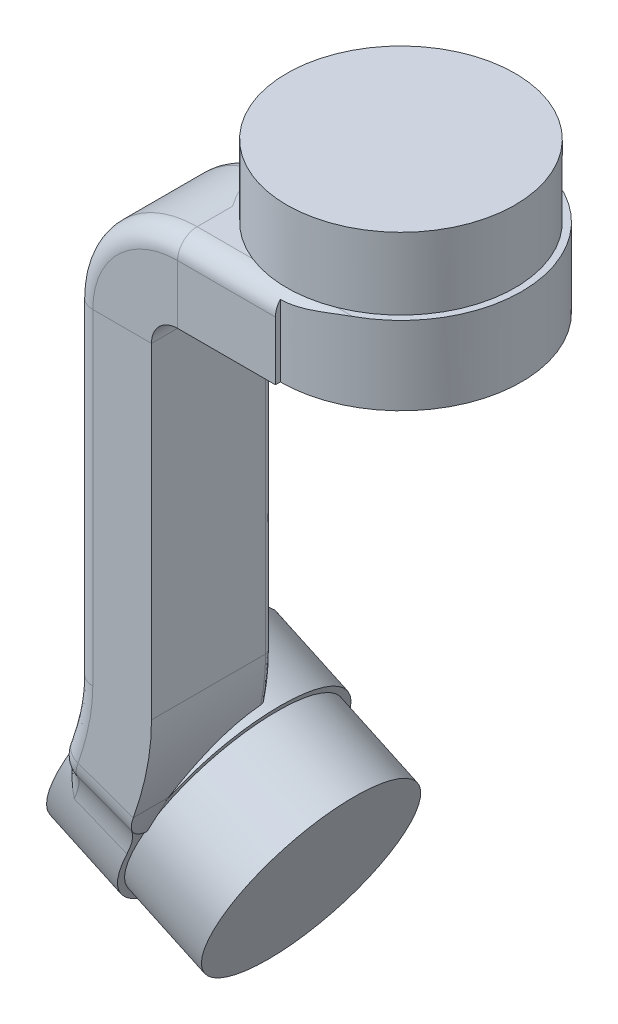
ISO-10303-21;
HEADER;
FILE_DESCRIPTION(('STEP AP214'),'2;1');
FILE_NAME('part.step','',(''),(''),'','','');
FILE_SCHEMA(('AUTOMOTIVE_DESIGN { 1 0 10303 214 1 1 1 1 }'));
ENDSEC;
DATA;
#1=APPLICATION_CONTEXT('core data for automotive mechanical design processes');
#2=APPLICATION_PROTOCOL_DEFINITION('international standard','automotive_design',2000,#1);
#3=PRODUCT_CONTEXT('',#1,'mechanical');
#4=PRODUCT('Part','Part','',(#3));
#5=PRODUCT_RELATED_PRODUCT_CATEGORY('part','',(#4));
#6=PRODUCT_DEFINITION_FORMATION('','',#4);
#7=PRODUCT_DEFINITION_CONTEXT('part definition',#1,'design');
#8=PRODUCT_DEFINITION('design','',#6,#7);
#9=PRODUCT_DEFINITION_SHAPE('','',#8);
#10=(LENGTH_UNIT() NAMED_UNIT(*) SI_UNIT(.MILLI.,.METRE.));
#11=(NAMED_UNIT(*) PLANE_ANGLE_UNIT() SI_UNIT($,.RADIAN.));
#12=(NAMED_UNIT(*) SI_UNIT($,.STERADIAN.) SOLID_ANGLE_UNIT());
#13=UNCERTAINTY_MEASURE_WITH_UNIT(LENGTH_MEASURE(1.E-05),#10,'distance_accuracy_value','');
#14=(GEOMETRIC_REPRESENTATION_CONTEXT(3) GLOBAL_UNCERTAINTY_ASSIGNED_CONTEXT((#13)) GLOBAL_UNIT_ASSIGNED_CONTEXT((#10,
#11,#12)) REPRESENTATION_CONTEXT('',''));
#15=CARTESIAN_POINT('',(0.,0.,0.));
#16=DIRECTION('',(0.,0.,1.));
#17=DIRECTION('',(1.,0.,0.));
#18=AXIS2_PLACEMENT_3D('',#15,#16,#17);
#19=CARTESIAN_POINT('',(-36.8215498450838,-71.8919592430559,8.38276080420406));
#20=CARTESIAN_POINT('',(-37.6749157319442,-74.2032793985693,6.59893425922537));
#21=CARTESIAN_POINT('',(-38.7334917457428,-77.0528133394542,6.48918689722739));
#22=CARTESIAN_POINT('',(-36.3633294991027,-72.0689735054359,8.37962147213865));
#23=CARTESIAN_POINT('',(-37.2187606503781,-74.3843545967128,6.59544368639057));
#24=CARTESIAN_POINT('',(-38.2792200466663,-77.2374872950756,6.49007842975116));
#25=CARTESIAN_POINT('',(-35.9051045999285,-72.2459860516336,8.37647930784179));
#26=CARTESIAN_POINT('',(-36.7626560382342,-74.5654309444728,6.59189254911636));
#27=CARTESIAN_POINT('',(-37.8249680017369,-77.4222237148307,6.49091235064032));
#28=CARTESIAN_POINT('',(-34.9886481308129,-72.6000114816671,8.37018673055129));
#29=CARTESIAN_POINT('',(-35.850459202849,-74.9276248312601,6.58466888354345));
#30=CARTESIAN_POINT('',(-36.9165040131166,-77.7918216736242,6.49246691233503));
#31=CARTESIAN_POINT('',(-34.5304165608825,-72.7770243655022,8.36703631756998));
#32=CARTESIAN_POINT('',(-35.3943639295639,-75.1087435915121,6.58099630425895));
#33=CARTESIAN_POINT('',(-36.4622920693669,-77.9766832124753,6.49318755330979));
#34=CARTESIAN_POINT('',(-29.7425117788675,-74.6265842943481,8.33406228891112));
#35=CARTESIAN_POINT('',(-30.6242721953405,-77.0032426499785,6.54195301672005));
#36=CARTESIAN_POINT('',(-31.7166225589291,-79.9088838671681,6.50013559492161));
#37=CARTESIAN_POINT('',(-25.4125912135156,-76.2993359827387,8.30376011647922));
#38=CARTESIAN_POINT('',(-26.314142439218,-78.7172944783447,6.50125343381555));
#39=CARTESIAN_POINT('',(-27.4269100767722,-81.6617782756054,6.50144892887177));
#40=CARTESIAN_POINT('',(-18.9181399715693,-78.8103800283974,8.25663253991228));
#41=CARTESIAN_POINT('',(-19.8563266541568,-81.2900102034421,6.43261273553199));
#42=CARTESIAN_POINT('',(-20.9949595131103,-84.2991939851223,6.49702305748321));
#43=CARTESIAN_POINT('',(-16.7533776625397,-79.6477206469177,8.24064416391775));
#44=CARTESIAN_POINT('',(-17.7023251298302,-82.1489043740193,6.40843422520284));
#45=CARTESIAN_POINT('',(-18.851395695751,-85.1796851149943,6.49448174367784));
#46=CARTESIAN_POINT('',(-12.424100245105,-81.3232145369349,8.20801221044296));
#47=CARTESIAN_POINT('',(-13.3950500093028,-83.8680362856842,6.357606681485));
#48=CARTESIAN_POINT('',(-14.5651299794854,-86.9432490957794,6.48741955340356));
#49=CARTESIAN_POINT('',(-10.2595851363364,-82.1613678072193,8.19136863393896));
#50=CARTESIAN_POINT('',(-11.2415178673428,-84.7283796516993,6.33095090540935));
#51=CARTESIAN_POINT('',(-12.4224280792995,-87.8263219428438,6.48289867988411));
#52=CARTESIAN_POINT('',(-8.09523678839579,-83.000017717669,8.17434885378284));
#53=CARTESIAN_POINT('',(-9.09012833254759,-85.5887377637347,6.30312261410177));
#54=CARTESIAN_POINT('',(-10.2801429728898,-88.7106343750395,6.47746424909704));
#55=(BOUNDED_SURFACE() B_SPLINE_SURFACE(3,2,((#19,#20,#21),(#22,#23,#24),(#25,#26,#27),(#28,#29,
#30),(#31,#32,#33),(#34,#35,#36),(#37,#38,#39),(#40,#41,#42),(#43,#44,#45),(#46,#47,#48),(#49,
#50,#51),(#52,#53,#54)),.UNSPECIFIED.,.F.,.F.,.F.) B_SPLINE_SURFACE_WITH_KNOTS((4,2,2,2,2,4),(3,
3),(0.,1.47405350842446,2.9481048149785,16.8758167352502,23.8397809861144,30.8037348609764),(0.,
1.),.UNSPECIFIED.) GEOMETRIC_REPRESENTATION_ITEM() RATIONAL_B_SPLINE_SURFACE(((1.,
0.956718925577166,1.),(1.,0.9566158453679,1.),(1.,0.956511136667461,1.),(1.,0.956298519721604,
1.),(1.,0.956190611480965,1.),(1.,0.955046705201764,1.),(1.,0.953872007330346,1.),(1.,
0.951927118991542,1.),(1.,0.951248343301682,1.),(1.,0.94983358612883,1.),(1.,0.949097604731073,
1.),(1.,0.948334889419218,1.))) REPRESENTATION_ITEM('') SURFACE());
#56=CARTESIAN_POINT('',(-36.8215498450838,-71.8919592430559,8.38276080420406));
#57=CARTESIAN_POINT('',(-36.3633294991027,-72.0689735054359,8.37962147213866));
#58=CARTESIAN_POINT('',(-35.9051045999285,-72.2459860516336,8.37647930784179));
#59=CARTESIAN_POINT('',(-34.9886481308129,-72.6000114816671,8.37018673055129));
#60=CARTESIAN_POINT('',(-34.5304165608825,-72.7770243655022,8.36703631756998));
#61=CARTESIAN_POINT('',(-29.7425117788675,-74.6265842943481,8.33406228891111));
#62=CARTESIAN_POINT('',(-25.4125912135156,-76.2993359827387,8.30376011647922));
#63=CARTESIAN_POINT('',(-18.9181399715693,-78.8103800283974,8.25663253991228));
#64=CARTESIAN_POINT('',(-16.7533776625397,-79.6477206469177,8.24064416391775));
#65=CARTESIAN_POINT('',(-12.424100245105,-81.3232145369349,8.20801221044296));
#66=CARTESIAN_POINT('',(-10.2595851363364,-82.1613678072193,8.19136863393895));
#67=CARTESIAN_POINT('',(-8.09523678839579,-83.000017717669,8.17434885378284));
#68=B_SPLINE_CURVE_WITH_KNOTS('',3,(#56,#57,#58,#59,#60,#61,#62,#63,#64,#65,#66,#67),
.UNSPECIFIED.,.F.,.F.,(4,2,2,2,2,4),(0.,1.47405350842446,2.9481048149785,16.8758167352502,
23.8397809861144,30.8037348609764),.UNSPECIFIED.);
#69=CARTESIAN_POINT('',(-31.2737268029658,-74.0351011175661,8.34453761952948));
#70=VERTEX_POINT('',#69);
#71=CARTESIAN_POINT('',(-23.0754938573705,-77.2030512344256,8.28672669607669));
#72=VERTEX_POINT('',#71);
#73=EDGE_CURVE('E653',#70,#72,#68,.T.);
#74=ORIENTED_EDGE('',*,*,#73,.F.);
#75=CARTESIAN_POINT('',(-33.111707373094,-70.4012828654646,6.74617758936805));
#76=CARTESIAN_POINT('',(-33.7705833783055,-72.249805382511,8.97136305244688));
#77=CARTESIAN_POINT('',(-30.983368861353,-73.2663831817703,8.99602569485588));
#78=CARTESIAN_POINT('',(-33.1383298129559,-70.475962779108,6.67106662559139));
#79=CARTESIAN_POINT('',(-33.7952512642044,-72.307533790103,8.91640792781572));
#80=CARTESIAN_POINT('',(-31.0051382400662,-73.3282581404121,8.93818211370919));
#81=CARTESIAN_POINT('',(-33.1652533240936,-70.5507840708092,6.59738890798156));
#82=CARTESIAN_POINT('',(-33.8202640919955,-72.3650540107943,8.86290295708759));
#83=CARTESIAN_POINT('',(-31.0273971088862,-73.3907629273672,8.88119703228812));
#84=CARTESIAN_POINT('',(-33.2199639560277,-70.7008902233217,6.45345856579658));
#85=CARTESIAN_POINT('',(-33.8704617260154,-72.4798644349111,8.75859736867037));
#86=CARTESIAN_POINT('',(-31.0730780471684,-73.5169109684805,8.76898420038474));
#87=CARTESIAN_POINT('',(-33.2477510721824,-70.7761750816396,6.38320592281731));
#88=CARTESIAN_POINT('',(-33.8956431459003,-72.537146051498,8.70780792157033));
#89=CARTESIAN_POINT('',(-31.096500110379,-73.580554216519,8.7137564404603));
#90=CARTESIAN_POINT('',(-33.3044370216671,-70.9273536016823,6.246716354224));
#91=CARTESIAN_POINT('',(-33.9455800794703,-72.6514867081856,8.60890704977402));
#92=CARTESIAN_POINT('',(-31.1446802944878,-73.7088277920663,8.60512410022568));
#93=CARTESIAN_POINT('',(-33.3333353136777,-71.0032469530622,6.18047751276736));
#94=CARTESIAN_POINT('',(-33.9703256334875,-72.7085234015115,8.56081646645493));
#95=CARTESIAN_POINT('',(-31.1694377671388,-73.773457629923,8.55171865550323));
#96=CARTESIAN_POINT('',(-33.3926806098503,-71.1563775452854,6.0522601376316));
#97=CARTESIAN_POINT('',(-34.0188960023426,-72.8230746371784,8.46677043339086));
#98=CARTESIAN_POINT('',(-31.2204489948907,-73.9036215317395,8.4467431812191));
#99=CARTESIAN_POINT('',(-33.4231276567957,-71.2336148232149,5.99028172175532));
#100=CARTESIAN_POINT('',(-34.042703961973,-72.8805509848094,8.42084782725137));
#101=CARTESIAN_POINT('',(-31.2467027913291,-73.9691556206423,8.39517320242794));
#102=CARTESIAN_POINT('',(-33.4984202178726,-71.4213119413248,5.84660511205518));
#103=CARTESIAN_POINT('',(-34.0986570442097,-73.0200586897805,8.31246674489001));
#104=CARTESIAN_POINT('',(-31.3114359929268,-74.1270896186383,8.27391409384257));
#105=CARTESIAN_POINT('',(-33.544203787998,-71.5328470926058,5.76678426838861));
#106=CARTESIAN_POINT('',(-34.130341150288,-73.1027199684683,8.25071860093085));
#107=CARTESIAN_POINT('',(-31.3506492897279,-74.2198795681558,8.20511138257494));
#108=CARTESIAN_POINT('',(-33.639958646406,-71.7616565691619,5.61251158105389));
#109=CARTESIAN_POINT('',(-34.19410735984,-73.2731460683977,8.12821698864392));
#110=CARTESIAN_POINT('',(-31.4317905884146,-74.4070105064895,8.07125586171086));
#111=CARTESIAN_POINT('',(-33.6899300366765,-71.8789310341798,5.53805986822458));
#112=CARTESIAN_POINT('',(-34.2261530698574,-73.3608072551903,8.06753066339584));
#113=CARTESIAN_POINT('',(-31.4737186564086,-74.5013515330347,8.00620314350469));
#114=CARTESIAN_POINT('',(-33.7933676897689,-72.1187033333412,5.39262615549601));
#115=CARTESIAN_POINT('',(-34.2927236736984,-73.5411449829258,7.94728020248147));
#116=CARTESIAN_POINT('',(-31.5597161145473,-74.6917297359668,7.87988428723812));
#117=CARTESIAN_POINT('',(-33.8468363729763,-72.2412047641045,5.32164661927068));
#118=CARTESIAN_POINT('',(-34.327233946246,-73.6337846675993,7.88773341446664));
#119=CARTESIAN_POINT('',(-31.6037869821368,-74.7877680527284,7.81862082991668));
#120=CARTESIAN_POINT('',(-33.9562777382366,-72.4902358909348,5.18281153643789));
#121=CARTESIAN_POINT('',(-34.3992375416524,-73.8229790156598,7.77071954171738));
#122=CARTESIAN_POINT('',(-31.69348303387,-74.9815601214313,7.69999409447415));
#123=CARTESIAN_POINT('',(-34.0122507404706,-72.616766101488,5.11495639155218));
#124=CARTESIAN_POINT('',(-34.4367290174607,-73.9195377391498,7.71323971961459));
#125=CARTESIAN_POINT('',(-31.739108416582,-75.0793140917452,7.64263131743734));
#126=CARTESIAN_POINT('',(-34.1264828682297,-72.8741962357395,4.98208490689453));
#127=CARTESIAN_POINT('',(-34.5147383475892,-74.1165921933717,7.60066539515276));
#128=CARTESIAN_POINT('',(-31.8319183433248,-75.277469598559,7.53136219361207));
#129=CARTESIAN_POINT('',(-34.1847585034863,-73.0051259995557,4.91710113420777));
#130=CARTESIAN_POINT('',(-34.5552874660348,-74.2171402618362,7.54557428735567));
#131=CARTESIAN_POINT('',(-31.8791134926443,-75.3778873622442,7.47749328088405));
#132=CARTESIAN_POINT('',(-34.3025873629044,-73.2696623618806,4.79112847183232));
#133=CARTESIAN_POINT('',(-34.6385669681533,-74.420714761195,7.43890641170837));
#134=CARTESIAN_POINT('',(-31.97434931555,-75.580441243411,7.37387199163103));
#135=CARTESIAN_POINT('',(-34.362140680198,-73.4032691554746,4.73013987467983));
#136=CARTESIAN_POINT('',(-34.6813057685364,-74.5237669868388,7.3873073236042));
#137=CARTESIAN_POINT('',(-32.0223900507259,-75.6825774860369,7.32411991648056));
#138=CARTESIAN_POINT('',(-34.5422157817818,-73.8076128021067,4.55382605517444));
#139=CARTESIAN_POINT('',(-34.8119415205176,-74.8358285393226,7.23845893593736));
#140=CARTESIAN_POINT('',(-32.1674649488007,-75.9914995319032,7.18112016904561));
#141=CARTESIAN_POINT('',(-34.6641443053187,-74.0818541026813,4.44516258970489));
#142=CARTESIAN_POINT('',(-34.9025156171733,-75.0483758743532,7.14681233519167));
#143=CARTESIAN_POINT('',(-32.2654449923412,-76.2007842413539,7.09413707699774));
#144=CARTESIAN_POINT('',(-34.9102355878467,-74.6380279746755,4.24795165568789));
#145=CARTESIAN_POINT('',(-35.0876556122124,-75.4800479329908,6.98064582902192));
#146=CARTESIAN_POINT('',(-32.4628658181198,-76.625328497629,6.93728894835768));
#147=CARTESIAN_POINT('',(-35.0344011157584,-74.9199703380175,4.15943127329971));
#148=CARTESIAN_POINT('',(-35.1822819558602,-75.6993164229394,6.90605018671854));
#149=CARTESIAN_POINT('',(-32.5623083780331,-76.8405956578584,6.86744695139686));
#150=CARTESIAN_POINT('',(-35.283833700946,-75.4896874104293,4.00406327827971));
#151=CARTESIAN_POINT('',(-35.3737827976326,-76.1428217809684,6.77486640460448));
#152=CARTESIAN_POINT('',(-32.7617684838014,-77.2757744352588,6.74540673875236));
#153=CARTESIAN_POINT('',(-35.4091007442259,-75.7774620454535,3.93721539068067));
#154=CARTESIAN_POINT('',(-35.470698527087,-76.3671545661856,6.71821492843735));
#155=CARTESIAN_POINT('',(-32.8617860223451,-77.4956859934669,6.69320829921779));
#156=CARTESIAN_POINT('',(-35.6777625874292,-76.3985229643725,3.81816729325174));
#157=CARTESIAN_POINT('',(-35.6794821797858,-76.8515839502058,6.61667052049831));
#158=CARTESIAN_POINT('',(-33.0759740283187,-77.9704993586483,6.6006114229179));
#159=CARTESIAN_POINT('',(-35.8212054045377,-76.7324687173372,3.76939543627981));
#160=CARTESIAN_POINT('',(-35.7915868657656,-77.1123907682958,6.57452084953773));
#161=CARTESIAN_POINT('',(-33.1901372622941,-78.2259351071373,6.56294148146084));
#162=CARTESIAN_POINT('',(-36.1074512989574,-77.4036848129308,3.70200266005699));
#163=CARTESIAN_POINT('',(-36.0159994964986,-77.636863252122,6.51473220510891));
#164=CARTESIAN_POINT('',(-33.4175666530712,-78.7395744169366,6.51128707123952));
#165=CARTESIAN_POINT('',(-36.250254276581,-77.7409556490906,3.68338628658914));
#166=CARTESIAN_POINT('',(-36.1283450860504,-77.9006144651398,6.49705814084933));
#167=CARTESIAN_POINT('',(-33.5308326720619,-78.997778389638,6.49730617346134));
#168=CARTESIAN_POINT('',(-36.5342946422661,-78.4165856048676,3.67669348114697));
#169=CARTESIAN_POINT('',(-36.3522445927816,-78.429118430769,6.48640880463));
#170=CARTESIAN_POINT('',(-33.7557384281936,-79.5152104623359,6.49316263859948));
#171=CARTESIAN_POINT('',(-36.6755311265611,-78.7549452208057,3.68863384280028));
#172=CARTESIAN_POINT('',(-36.4638291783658,-78.6939426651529,6.49342425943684));
#173=CARTESIAN_POINT('',(-33.8673772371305,-79.7744390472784,6.50301309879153));
#174=CARTESIAN_POINT('',(-36.9554049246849,-79.4301199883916,3.74308590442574));
#175=CARTESIAN_POINT('',(-36.6852347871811,-79.2224440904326,6.53208541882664));
#176=CARTESIAN_POINT('',(-34.0882218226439,-80.2918766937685,6.54646586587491));
#177=CARTESIAN_POINT('',(-37.0940424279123,-79.7669352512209,3.78559536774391));
#178=CARTESIAN_POINT('',(-36.7950826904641,-79.4861833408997,6.56371868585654));
#179=CARTESIAN_POINT('',(-34.1974277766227,-80.5500858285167,6.58006643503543));
#180=CARTESIAN_POINT('',(-37.2309140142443,-80.1017793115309,3.84338824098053));
#181=CARTESIAN_POINT('',(-36.9036114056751,-79.7483916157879,6.60765126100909));
#182=CARTESIAN_POINT('',(-34.3050540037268,-80.8068531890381,6.62549591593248));
#183=(BOUNDED_SURFACE() B_SPLINE_SURFACE(3,2,((#75,#76,#77),(#78,#79,#80),(#81,#82,#83),(#84,
#85,#86),(#87,#88,#89),(#90,#91,#92),(#93,#94,#95),(#96,#97,#98),(#99,#100,#101),(#102,#103,
#104),(#105,#106,#107),(#108,#109,#110),(#111,#112,#113),(#114,#115,#116),(#117,#118,#119),
(#120,#121,#122),(#123,#124,#125),(#126,#127,#128),(#129,#130,#131),(#132,#133,#134),(#135,#136,
#137),(#138,#139,#140),(#141,#142,#143),(#144,#145,#146),(#147,#148,#149),(#150,#151,#152),
(#153,#154,#155),(#156,#157,#158),(#159,#160,#161),(#162,#163,#164),(#165,#166,#167),(#168,#169,
#170),(#171,#172,#173),(#174,#175,#176),(#177,#178,#179),(#180,#181,#182)),.UNSPECIFIED.,.F.,
.F.,.F.) B_SPLINE_SURFACE_WITH_KNOTS((4,2,2,2,2,2,2,2,2,2,2,2,2,2,2,2,2,4),(3,3),(0.,
0.34105192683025,0.682102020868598,1.02298802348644,1.36388344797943,1.83939152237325,
2.31491118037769,2.79076348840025,3.26667680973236,3.74705059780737,4.22745952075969,
5.18834685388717,6.15051874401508,7.1126784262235,8.21147799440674,9.3104431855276,
10.4100124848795,11.5095013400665),(0.,1.),
.UNSPECIFIED.) GEOMETRIC_REPRESENTATION_ITEM() RATIONAL_B_SPLINE_SURFACE(((1.,0.711016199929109,
1.),(1.,0.710528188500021,1.),(1.,0.710022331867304,1.),(1.,0.709061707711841,1.),(1.,
0.708606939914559,1.),(1.,0.707835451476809,1.),(1.,0.707518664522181,1.),(1.,0.707122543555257,
1.),(1.,0.707043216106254,1.),(1.,0.707196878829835,1.),(1.,0.707565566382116,1.),(1.,
0.70870090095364,1.),(1.,0.709467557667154,1.),(1.,0.711115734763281,1.),(1.,0.711997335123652,
1.),(1.,0.713711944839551,1.),(1.,0.714544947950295,1.),(1.,0.716116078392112,1.),(1.,
0.716853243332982,1.),(1.,0.718220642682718,1.),(1.,0.718850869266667,1.),(1.,0.720602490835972,
1.),(1.,0.72158471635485,1.),(1.,0.723300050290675,1.),(1.,0.724032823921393,1.),(1.,
0.725326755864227,1.),(1.,0.725887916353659,1.),(1.,0.726955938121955,1.),(1.,0.727443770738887,
1.),(1.,0.728296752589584,1.),(1.,0.728661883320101,1.),(1.,0.729293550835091,1.),(1.,
0.729560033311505,1.),(1.,0.730008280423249,1.),(1.,0.730190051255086,1.),(1.,0.730336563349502,1.))) REPRESENTATION_ITEM('') SURFACE());
#184=CARTESIAN_POINT('',(-30.983368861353,-73.2663831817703,8.99602569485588));
#185=CARTESIAN_POINT('',(-31.0051382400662,-73.3282581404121,8.93818211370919));
#186=CARTESIAN_POINT('',(-31.0273971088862,-73.3907629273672,8.88119703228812));
#187=CARTESIAN_POINT('',(-31.0730780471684,-73.5169109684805,8.76898420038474));
#188=CARTESIAN_POINT('',(-31.096500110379,-73.580554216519,8.7137564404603));
#189=CARTESIAN_POINT('',(-31.1446802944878,-73.7088277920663,8.60512410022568));
#190=CARTESIAN_POINT('',(-31.1694377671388,-73.773457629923,8.55171865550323));
#191=CARTESIAN_POINT('',(-31.2204489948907,-73.9036215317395,8.4467431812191));
#192=CARTESIAN_POINT('',(-31.2467027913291,-73.9691556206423,8.39517320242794));
#193=CARTESIAN_POINT('',(-31.3114359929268,-74.1270896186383,8.27391409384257));
#194=CARTESIAN_POINT('',(-31.3506492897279,-74.2198795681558,8.20511138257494));
#195=CARTESIAN_POINT('',(-31.4317905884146,-74.4070105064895,8.07125586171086));
#196=CARTESIAN_POINT('',(-31.4737186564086,-74.5013515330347,8.00620314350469));
#197=CARTESIAN_POINT('',(-31.5597161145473,-74.6917297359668,7.87988428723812));
#198=CARTESIAN_POINT('',(-31.6037869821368,-74.7877680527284,7.81862082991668));
#199=CARTESIAN_POINT('',(-31.69348303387,-74.9815601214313,7.69999409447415));
#200=CARTESIAN_POINT('',(-31.739108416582,-75.0793140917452,7.64263131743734));
#201=CARTESIAN_POINT('',(-31.8319183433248,-75.277469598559,7.53136219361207));
#202=CARTESIAN_POINT('',(-31.8791134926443,-75.3778873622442,7.47749328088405));
#203=CARTESIAN_POINT('',(-31.97434931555,-75.580441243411,7.37387199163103));
#204=CARTESIAN_POINT('',(-32.0223900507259,-75.6825774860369,7.32411991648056));
#205=CARTESIAN_POINT('',(-32.1674649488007,-75.9914995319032,7.1811201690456));
#206=CARTESIAN_POINT('',(-32.2654449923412,-76.2007842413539,7.09413707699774));
#207=CARTESIAN_POINT('',(-32.4628658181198,-76.625328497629,6.93728894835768));
#208=CARTESIAN_POINT('',(-32.562308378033,-76.8405956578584,6.86744695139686));
#209=CARTESIAN_POINT('',(-32.7617684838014,-77.2757744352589,6.74540673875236));
#210=CARTESIAN_POINT('',(-32.8617860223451,-77.4956859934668,6.69320829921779));
#211=CARTESIAN_POINT('',(-33.0759740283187,-77.9704993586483,6.6006114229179));
#212=CARTESIAN_POINT('',(-33.1901372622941,-78.2259351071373,6.56294148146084));
#213=CARTESIAN_POINT('',(-33.4175666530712,-78.7395744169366,6.51128707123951));
#214=CARTESIAN_POINT('',(-33.5308326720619,-78.997778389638,6.49730617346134));
#215=CARTESIAN_POINT('',(-33.7557384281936,-79.5152104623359,6.49316263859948));
#216=CARTESIAN_POINT('',(-33.8673772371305,-79.7744390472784,6.50301309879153));
#217=CARTESIAN_POINT('',(-34.0882218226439,-80.2918766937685,6.54646586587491));
#218=CARTESIAN_POINT('',(-34.1974277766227,-80.5500858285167,6.58006643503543));
#219=CARTESIAN_POINT('',(-34.3050540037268,-80.8068531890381,6.62549591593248));
#220=B_SPLINE_CURVE_WITH_KNOTS('',3,(#184,#185,#186,#187,#188,#189,#190,#191,#192,#193,#194,
#195,#196,#197,#198,#199,#200,#201,#202,#203,#204,#205,#206,#207,#208,#209,#210,#211,#212,#213,
#214,#215,#216,#217,#218,#219),.UNSPECIFIED.,.F.,.F.,(4,2,2,2,2,2,2,2,2,2,2,2,2,2,2,2,2,4),(0.,
0.34105192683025,0.682102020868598,1.02298802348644,1.36388344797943,1.83939152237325,
2.31491118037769,2.79076348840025,3.26667680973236,3.74705059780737,4.22745952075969,
5.18834685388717,6.15051874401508,7.1126784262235,8.21147799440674,9.3104431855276,
10.4100124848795,11.5095013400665),.UNSPECIFIED.);
#221=CARTESIAN_POINT('',(-33.5947072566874,-79.1448848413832,6.49686608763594));
#222=VERTEX_POINT('',#221);
#223=EDGE_CURVE('E595',#70,#222,#220,.T.);
#224=ORIENTED_EDGE('',*,*,#223,.T.);
#225=CARTESIAN_POINT('',(-10.2801429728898,-88.7106343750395,6.47746424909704));
#226=CARTESIAN_POINT('',(-12.4224280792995,-87.8263219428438,6.48289867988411));
#227=CARTESIAN_POINT('',(-14.5651299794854,-86.9432490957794,6.48741955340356));
#228=CARTESIAN_POINT('',(-18.8513956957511,-85.1796851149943,6.49448174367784));
#229=CARTESIAN_POINT('',(-20.9949595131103,-84.2991939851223,6.49702305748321));
#230=CARTESIAN_POINT('',(-27.4269100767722,-81.6617782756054,6.50144892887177));
#231=CARTESIAN_POINT('',(-31.7166225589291,-79.9088838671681,6.50013559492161));
#232=CARTESIAN_POINT('',(-36.4622920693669,-77.9766832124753,6.49318755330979));
#233=CARTESIAN_POINT('',(-36.9165040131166,-77.7918216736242,6.49246691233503));
#234=CARTESIAN_POINT('',(-37.8249680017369,-77.4222237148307,6.49091235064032));
#235=CARTESIAN_POINT('',(-38.2792200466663,-77.2374872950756,6.49007842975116));
#236=CARTESIAN_POINT('',(-38.7334917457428,-77.0528133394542,6.48918689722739));
#237=B_SPLINE_CURVE_WITH_KNOTS('',3,(#225,#226,#227,#228,#229,#230,#231,#232,#233,#234,#235,
#236),.UNSPECIFIED.,.F.,.F.,(4,2,2,2,2,4),(0.,6.96395387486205,13.9279181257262,
27.8556300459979,29.329681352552,30.8037348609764),.UNSPECIFIED.);
#238=CARTESIAN_POINT('',(-25.5196157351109,-82.4444875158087,6.49969299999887));
#239=VERTEX_POINT('',#238);
#240=EDGE_CURVE('E313',#239,#222,#237,.T.);
#241=ORIENTED_EDGE('',*,*,#240,.F.);
#242=CARTESIAN_POINT('',(-25.5196157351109,-82.4444875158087,6.49969299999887));
#243=CARTESIAN_POINT('',(-25.4102458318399,-82.2099430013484,6.49809436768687));
#244=CARTESIAN_POINT('',(-25.300850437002,-81.9753438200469,6.50652374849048));
#245=CARTESIAN_POINT('',(-25.0826714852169,-81.5074575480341,6.54329609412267));
#246=CARTESIAN_POINT('',(-24.9738878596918,-81.2741703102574,6.57163678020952));
#247=CARTESIAN_POINT('',(-24.7601562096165,-80.815821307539,6.64717494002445));
#248=CARTESIAN_POINT('',(-24.6551786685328,-80.5906962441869,6.69390531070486));
#249=CARTESIAN_POINT('',(-24.4470056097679,-80.1442676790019,6.80593271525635));
#250=CARTESIAN_POINT('',(-24.3438101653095,-79.9229643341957,6.87123051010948));
#251=CARTESIAN_POINT('',(-24.1291492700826,-79.4626225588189,7.02780184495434));
#252=CARTESIAN_POINT('',(-24.0179430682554,-79.224140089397,7.12107356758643));
#253=CARTESIAN_POINT('',(-23.7991860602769,-78.7550141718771,7.32919132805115));
#254=CARTESIAN_POINT('',(-23.6916356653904,-78.5243716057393,7.44403978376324));
#255=CARTESIAN_POINT('',(-23.4780977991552,-78.0664381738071,7.69792591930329));
#256=CARTESIAN_POINT('',(-23.3722313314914,-77.8394068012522,7.83753395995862));
#257=CARTESIAN_POINT('',(-23.1659260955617,-77.3969837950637,8.13764713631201));
#258=CARTESIAN_POINT('',(-23.065487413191,-77.1815923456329,8.29815260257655));
#259=CARTESIAN_POINT('',(-22.9681506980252,-76.97285308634,8.46858238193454));
#260=B_SPLINE_CURVE_WITH_KNOTS('',3,(#242,#243,#244,#245,#246,#247,#248,#249,#250,#251,#252,
#253,#254,#255,#256,#257,#258,#259),.UNSPECIFIED.,.F.,.F.,(4,2,2,2,2,2,2,2,4),(0.,
0.776195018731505,1.55230122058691,2.30984937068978,3.06742857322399,3.90397754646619,
4.74062031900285,5.59989787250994,6.45918902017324),.UNSPECIFIED.);
#261=EDGE_CURVE('E627',#239,#72,#260,.T.);
#262=ORIENTED_EDGE('',*,*,#261,.T.);
#263=EDGE_LOOP('',(#74,#224,#241,#262));
#264=FACE_BOUND('',#263,.T.);
#265=ADVANCED_FACE('F35',(#264),#55,.F.);
#266=CARTESIAN_POINT('',(-25.5621532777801,-82.5357095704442,-10.));
#267=DIRECTION('',(-0.906307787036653,0.422618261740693,0.));
#268=DIRECTION('',(-0.422618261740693,-0.906307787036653,0.));
#269=AXIS2_PLACEMENT_3D('',#266,#267,#268);
#270=CYLINDRICAL_SURFACE('',#269,16.5);
#271=CARTESIAN_POINT('',(-25.5621532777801,-82.5357095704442,-10.));
#272=DIRECTION('',(0.906307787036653,-0.422618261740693,0.));
#273=DIRECTION('',(0.422618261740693,0.906307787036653,0.));
#274=AXIS2_PLACEMENT_3D('',#271,#272,#273);
#275=CIRCLE('',#274,16.5);
#276=CARTESIAN_POINT('',(-21.9496130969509,-74.7885921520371,4.11317558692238));
#277=VERTEX_POINT('',#276);
#278=EDGE_CURVE('E257',#239,#277,#275,.T.);
#279=ORIENTED_EDGE('',*,*,#278,.F.);
#280=ORIENTED_EDGE('',*,*,#240,.T.);
#281=CARTESIAN_POINT('',(-33.7972645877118,-72.127216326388,5.388694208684));
#282=CARTESIAN_POINT('',(-33.8540165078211,-72.2693924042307,5.4478380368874));
#283=CARTESIAN_POINT('',(-33.9037733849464,-72.4152063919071,5.50445855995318));
#284=CARTESIAN_POINT('',(-33.9905288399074,-72.7121186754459,5.61241582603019));
#285=CARTESIAN_POINT('',(-34.0275549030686,-72.8632048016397,5.66376378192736));
#286=CARTESIAN_POINT('',(-34.0899355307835,-73.167448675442,5.76060678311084));
#287=CARTESIAN_POINT('',(-34.1154260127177,-73.3205591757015,5.80616517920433));
#288=CARTESIAN_POINT('',(-34.1566201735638,-73.62955834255,5.89227828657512));
#289=CARTESIAN_POINT('',(-34.1723171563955,-73.7854488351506,5.93282955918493));
#290=CARTESIAN_POINT('',(-34.2030733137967,-74.2096108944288,6.03596618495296));
#291=CARTESIAN_POINT('',(-34.2098782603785,-74.4796165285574,6.09392627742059));
#292=CARTESIAN_POINT('',(-34.2034833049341,-75.0218051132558,6.19691206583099));
#293=CARTESIAN_POINT('',(-34.1902715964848,-75.2939892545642,6.2419301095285));
#294=CARTESIAN_POINT('',(-34.1481355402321,-75.8405445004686,6.32050284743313));
#295=CARTESIAN_POINT('',(-34.1191090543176,-76.1149182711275,6.35398069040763));
#296=CARTESIAN_POINT('',(-34.04923368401,-76.6631215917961,6.41015363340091));
#297=CARTESIAN_POINT('',(-34.0083877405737,-76.9369512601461,6.43285141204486));
#298=CARTESIAN_POINT('',(-33.9105154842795,-77.5315469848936,6.47144079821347));
#299=CARTESIAN_POINT('',(-33.8519095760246,-77.8521680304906,6.48545441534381));
#300=CARTESIAN_POINT('',(-33.7284177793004,-78.4917611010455,6.50071900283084));
#301=CARTESIAN_POINT('',(-33.6635455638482,-78.8107351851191,6.50199715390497));
#302=CARTESIAN_POINT('',(-33.5968324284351,-79.1345720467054,6.49702914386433));
#303=CARTESIAN_POINT('',(-33.5957699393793,-79.1397284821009,6.49694842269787));
#304=CARTESIAN_POINT('',(-33.5947072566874,-79.1448848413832,6.49686608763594));
#305=B_SPLINE_CURVE_WITH_KNOTS('',3,(#281,#282,#283,#284,#285,#286,#287,#288,#289,#290,#291,
#292,#293,#294,#295,#296,#297,#298,#299,#300,#301,#302,#303,#304),.UNSPECIFIED.,.F.,.F.,(4,2,2,
2,2,2,2,2,2,2,2,4),(0.,0.491872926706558,0.982677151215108,1.46753748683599,1.95272897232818,
2.78003969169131,3.60783857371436,4.4410481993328,5.27405068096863,6.2523646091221,
7.22859011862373,7.24438625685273),.UNSPECIFIED.);
#306=CARTESIAN_POINT('',(-33.7972645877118,-72.127216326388,5.388694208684));
#307=VERTEX_POINT('',#306);
#308=EDGE_CURVE('E327',#222,#307,#305,.F.);
#309=ORIENTED_EDGE('',*,*,#308,.T.);
#310=CARTESIAN_POINT('',(-33.1021128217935,-70.3743344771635,4.52088582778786));
#311=CARTESIAN_POINT('',(-33.1021320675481,-70.3743833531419,4.520914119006));
#312=CARTESIAN_POINT('',(-33.1021513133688,-70.3744322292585,4.5209424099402));
#313=CARTESIAN_POINT('',(-33.1021920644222,-70.3745357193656,4.52100231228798));
#314=CARTESIAN_POINT('',(-33.1022135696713,-70.3745903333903,4.52103392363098));
#315=CARTESIAN_POINT('',(-33.1023210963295,-70.3748634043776,4.52119197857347));
#316=CARTESIAN_POINT('',(-33.1024071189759,-70.3750818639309,4.5213184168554));
#317=CARTESIAN_POINT('',(-33.1028372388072,-70.3761741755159,4.52195057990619));
#318=CARTESIAN_POINT('',(-33.1031813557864,-70.3770480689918,4.5224562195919));
#319=CARTESIAN_POINT('',(-33.1049020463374,-70.381417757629,4.52498396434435));
#320=CARTESIAN_POINT('',(-33.1062789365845,-70.3849142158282,4.5270047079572));
#321=CARTESIAN_POINT('',(-33.1131650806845,-70.4024000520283,4.53710117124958));
#322=CARTESIAN_POINT('',(-33.118679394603,-70.4164000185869,4.54515509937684));
#323=CARTESIAN_POINT('',(-33.1462782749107,-70.4864570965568,4.58530892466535));
#324=CARTESIAN_POINT('',(-33.1684435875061,-70.5426829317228,4.617059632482));
#325=CARTESIAN_POINT('',(-33.2797187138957,-70.8247545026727,4.77397588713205));
#326=CARTESIAN_POINT('',(-33.3700982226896,-71.0532344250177,4.8935178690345));
#327=CARTESIAN_POINT('',(-33.6460463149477,-71.7488644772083,5.23494648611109));
#328=CARTESIAN_POINT('',(-33.8355047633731,-72.2238589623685,5.43816893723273));
#329=CARTESIAN_POINT('',(-34.1260743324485,-72.9480838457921,5.70413941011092));
#330=CARTESIAN_POINT('',(-34.2240700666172,-73.1916339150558,5.78636587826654));
#331=CARTESIAN_POINT('',(-34.4219887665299,-73.6820691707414,5.9376527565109));
#332=CARTESIAN_POINT('',(-34.521911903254,-73.9289546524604,6.00671199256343));
#333=CARTESIAN_POINT('',(-34.77746563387,-74.5584567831,6.16489662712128));
#334=CARTESIAN_POINT('',(-34.9342563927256,-74.9429174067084,6.24494595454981));
#335=CARTESIAN_POINT('',(-35.251036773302,-75.7159323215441,6.37303875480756));
#336=CARTESIAN_POINT('',(-35.4110272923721,-76.1044877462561,6.42107311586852));
#337=CARTESIAN_POINT('',(-35.7335394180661,-76.8837933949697,6.4848432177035));
#338=CARTESIAN_POINT('',(-35.8960640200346,-77.2745458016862,6.50053726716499));
#339=CARTESIAN_POINT('',(-36.2225357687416,-78.0553055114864,6.49943377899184));
#340=CARTESIAN_POINT('',(-36.3864825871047,-78.4453129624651,6.48264355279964));
#341=CARTESIAN_POINT('',(-36.5507239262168,-78.8338153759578,6.44958047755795));
#342=B_SPLINE_CURVE_WITH_KNOTS('',3,(#310,#311,#312,#313,#314,#315,#316,#317,#318,#319,#320,
#321,#322,#323,#324,#325,#326,#327,#328,#329,#330,#331,#332,#333,#334,#335,#336,#337,#338,#339,
#340,#341),.UNSPECIFIED.,.F.,.F.,(4,2,2,2,2,2,2,2,2,2,2,2,2,2,2,4),(0.,0.000178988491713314,
0.00037898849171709,0.00117898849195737,0.00437898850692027,0.0171789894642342,
0.0683790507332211,0.273182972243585,1.0926342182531,2.74024635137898,3.56528543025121,
4.39039803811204,5.65763477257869,6.92523202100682,8.19446236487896,9.46340706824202),.UNSPECIFIED.);
#343=CARTESIAN_POINT('',(-33.1021128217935,-70.3743344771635,4.52088582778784));
#344=VERTEX_POINT('',#343);
#345=EDGE_CURVE('E298',#344,#307,#342,.T.);
#346=ORIENTED_EDGE('',*,*,#345,.F.);
#347=CARTESIAN_POINT('',(-33.1021128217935,-70.3743344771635,4.52088582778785));
#348=CARTESIAN_POINT('',(-33.0866090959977,-70.3307384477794,4.49602995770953));
#349=CARTESIAN_POINT('',(-33.0712044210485,-70.2872332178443,4.4709582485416));
#350=CARTESIAN_POINT('',(-33.0405931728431,-70.2004043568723,4.42038315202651));
#351=CARTESIAN_POINT('',(-33.025386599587,-70.1570807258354,4.39487976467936));
#352=CARTESIAN_POINT('',(-33.0102790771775,-70.1138478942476,4.36916053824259));
#353=B_SPLINE_CURVE_WITH_KNOTS('',3,(#347,#348,#349,#350,#351,#352),.UNSPECIFIED.,.F.,.F.,(4,2,
4),(0.,0.157567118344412,0.315134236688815),.UNSPECIFIED.);
#354=CARTESIAN_POINT('',(-33.0102790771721,-70.1138478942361,4.36916053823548));
#355=VERTEX_POINT('',#354);
#356=EDGE_CURVE('E289',#344,#355,#353,.T.);
#357=ORIENTED_EDGE('',*,*,#356,.T.);
#358=CARTESIAN_POINT('',(-36.4378467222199,-77.4642904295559,-10.));
#359=DIRECTION('',(0.906307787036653,-0.422618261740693,0.));
#360=DIRECTION('',(0.422618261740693,0.906307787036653,0.));
#361=AXIS2_PLACEMENT_3D('',#358,#359,#360);
#362=CIRCLE('',#361,16.5);
#363=CARTESIAN_POINT('',(-29.4790856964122,-62.5411792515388,-8.9386811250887));
#364=VERTEX_POINT('',#363);
#365=EDGE_CURVE('E256',#355,#364,#362,.T.);
#366=ORIENTED_EDGE('',*,*,#365,.T.);
#367=CARTESIAN_POINT('',(-28.0000000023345,-56.2129571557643,-9.25));
#368=CARTESIAN_POINT('',(-31.0000000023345,-56.2129571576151,-9.25));
#369=CARTESIAN_POINT('',(-31.0000000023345,-56.2129571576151,-6.25));
#370=CARTESIAN_POINT('',(-28.0000000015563,-57.4753047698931,-9.25));
#371=CARTESIAN_POINT('',(-31.0000000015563,-57.4753047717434,-9.25));
#372=CARTESIAN_POINT('',(-31.0000000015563,-57.4753047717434,-6.25));
#373=CARTESIAN_POINT('',(-28.0000000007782,-58.7376523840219,-9.25));
#374=CARTESIAN_POINT('',(-31.0000000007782,-58.7376523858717,-9.25));
#375=CARTESIAN_POINT('',(-31.0000000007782,-58.7376523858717,-6.25));
#376=CARTESIAN_POINT('',(-28.,-59.9999999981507,-9.25));
#377=CARTESIAN_POINT('',(-31.,-60.,-9.25));
#378=CARTESIAN_POINT('',(-31.,-60.,-6.25));
#379=CARTESIAN_POINT('',(-28.0000306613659,-60.3172338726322,-9.25));
#380=CARTESIAN_POINT('',(-31.0000057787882,-60.2722466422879,-9.25));
#381=CARTESIAN_POINT('',(-31.0000057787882,-60.2722466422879,-6.25));
#382=CARTESIAN_POINT('',(-28.0071372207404,-60.6344102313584,-9.25));
#383=CARTESIAN_POINT('',(-31.006125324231,-60.54672183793,-9.25));
#384=CARTESIAN_POINT('',(-31.0061253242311,-60.54672183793,-6.25000000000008));
#385=CARTESIAN_POINT('',(-28.034261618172,-61.2681114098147,-9.25));
#386=CARTESIAN_POINT('',(-31.0297790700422,-61.0990837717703,-9.25));
#387=CARTESIAN_POINT('',(-31.0297790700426,-61.0990837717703,-6.25000000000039));
#388=CARTESIAN_POINT('',(-28.0542750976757,-61.5846364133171,-9.25));
#389=CARTESIAN_POINT('',(-31.0473094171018,-61.3769693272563,-9.25));
#390=CARTESIAN_POINT('',(-31.0473094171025,-61.3769693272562,-6.25000000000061));
#391=CARTESIAN_POINT('',(-28.1059332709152,-62.2162089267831,-9.25));
#392=CARTESIAN_POINT('',(-31.092936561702,-61.9348461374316,-9.25));
#393=CARTESIAN_POINT('',(-31.0929365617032,-61.9348461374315,-6.25000000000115));
#394=CARTESIAN_POINT('',(-28.1375593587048,-62.531257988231,-9.25));
#395=CARTESIAN_POINT('',(-31.1210164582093,-62.2148333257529,-9.25));
#396=CARTESIAN_POINT('',(-31.1210164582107,-62.2148333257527,-6.25000000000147));
#397=CARTESIAN_POINT('',(-28.21142162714,-63.160125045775,-9.25));
#398=CARTESIAN_POINT('',(-31.1870031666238,-62.7766507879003,-9.25));
#399=CARTESIAN_POINT('',(-31.1870031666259,-62.7766507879,-6.25000000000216));
#400=CARTESIAN_POINT('',(-28.2536588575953,-63.4739429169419,-9.25));
#401=CARTESIAN_POINT('',(-31.2249109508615,-63.0584812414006,-9.25));
#402=CARTESIAN_POINT('',(-31.224910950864,-63.0584812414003,-6.25000000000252));
#403=CARTESIAN_POINT('',(-28.394750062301,-64.412281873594,-9.25));
#404=CARTESIAN_POINT('',(-31.3521969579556,-63.9049710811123,-9.25000000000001));
#405=CARTESIAN_POINT('',(-31.3521969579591,-63.9049710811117,-6.25000000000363));
#406=CARTESIAN_POINT('',(-28.5080686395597,-65.0346579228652,-9.25));
#407=CARTESIAN_POINT('',(-31.4552121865,-64.4714880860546,-9.25));
#408=CARTESIAN_POINT('',(-31.4552121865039,-64.471488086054,-6.25000000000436));
#409=CARTESIAN_POINT('',(-28.7673477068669,-66.2727497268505,-9.25));
#410=CARTESIAN_POINT('',(-31.6928130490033,-65.6060964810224,-9.25));
#411=CARTESIAN_POINT('',(-31.6928130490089,-65.6060964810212,-6.25000000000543));
#412=CARTESIAN_POINT('',(-28.9133243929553,-66.8884620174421,-9.25));
#413=CARTESIAN_POINT('',(-31.8274143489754,-66.1741885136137,-9.25));
#414=CARTESIAN_POINT('',(-31.8274143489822,-66.1741885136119,-6.25000000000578));
#415=CARTESIAN_POINT('',(-29.2330971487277,-68.1118625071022,-9.25));
#416=CARTESIAN_POINT('',(-32.1240011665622,-67.3088868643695,-9.25));
#417=CARTESIAN_POINT('',(-32.1240011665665,-67.3088868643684,-6.25000000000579));
#418=CARTESIAN_POINT('',(-29.406863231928,-68.7195585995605,-9.25));
#419=CARTESIAN_POINT('',(-32.285957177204,-67.875494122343,-9.25));
#420=CARTESIAN_POINT('',(-32.2859571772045,-67.8754941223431,-6.25000000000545));
#421=CARTESIAN_POINT('',(-29.7786708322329,-69.9274581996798,-9.25));
#422=CARTESIAN_POINT('',(-32.6340573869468,-69.0063786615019,-9.25));
#423=CARTESIAN_POINT('',(-32.6340573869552,-69.006378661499,-6.25000000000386));
#424=CARTESIAN_POINT('',(-29.9767124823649,-70.5276616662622,-9.25));
#425=CARTESIAN_POINT('',(-32.8202017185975,-69.5706559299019,-9.24999999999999));
#426=CARTESIAN_POINT('',(-32.8202017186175,-69.5706559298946,-6.2500000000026));
#427=CARTESIAN_POINT('',(-30.2152351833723,-71.2093109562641,-9.25));
#428=CARTESIAN_POINT('',(-33.0451936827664,-70.2136402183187,-9.25));
#429=CARTESIAN_POINT('',(-33.0451936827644,-70.2136402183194,-6.25000000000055));
#430=CARTESIAN_POINT('',(-30.2452780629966,-71.294468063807,-9.25));
#431=CARTESIAN_POINT('',(-33.0735458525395,-70.2940054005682,-9.25));
#432=CARTESIAN_POINT('',(-33.0735458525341,-70.2940054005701,-6.25000000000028));
#433=CARTESIAN_POINT('',(-30.2755342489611,-71.3795476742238,-9.25));
#434=CARTESIAN_POINT('',(-33.1021128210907,-70.3743344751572,-9.25));
#435=CARTESIAN_POINT('',(-33.1021128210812,-70.3743344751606,-6.25));
#436=CARTESIAN_POINT('',(-30.6682584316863,-72.4838564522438,-9.25));
#437=CARTESIAN_POINT('',(-33.494837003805,-71.4786432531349,-9.25));
#438=CARTESIAN_POINT('',(-33.4948370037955,-71.4786432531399,-6.24999999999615));
#439=CARTESIAN_POINT('',(-31.0609826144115,-73.5881652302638,-9.25));
#440=CARTESIAN_POINT('',(-33.8875611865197,-72.5829520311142,-9.25));
#441=CARTESIAN_POINT('',(-33.8875611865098,-72.5829520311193,-6.2499999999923));
#442=CARTESIAN_POINT('',(-31.4537067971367,-74.6924740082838,-9.25));
#443=CARTESIAN_POINT('',(-34.280285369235,-73.6872608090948,-9.25));
#444=CARTESIAN_POINT('',(-34.2802853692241,-73.6872608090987,-6.24999999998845));
#445=(BOUNDED_SURFACE() B_SPLINE_SURFACE(3,2,((#367,#368,#369),(#370,#371,#372),(#373,#374,
#375),(#376,#377,#378),(#379,#380,#381),(#382,#383,#384),(#385,#386,#387),(#388,#389,#390),
(#391,#392,#393),(#394,#395,#396),(#397,#398,#399),(#400,#401,#402),(#403,#404,#405),(#406,#407,
#408),(#409,#410,#411),(#412,#413,#414),(#415,#416,#417),(#418,#419,#420),(#421,#422,#423),
(#424,#425,#426),(#427,#428,#429),(#430,#431,#432),(#433,#434,#435),(#436,#437,#438),(#439,#440,
#441),(#442,#443,#444)),.UNSPECIFIED.,.F.,.F.,.F.) B_SPLINE_SURFACE_WITH_KNOTS((4,3,2,2,2,2,2,2,
2,2,3,4),(3,3),(0.,3.78704284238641,4.73858236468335,5.68980072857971,6.63950163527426,
7.58929653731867,9.48597169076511,11.3835895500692,13.2791734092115,15.1747676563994,
15.445669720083,18.9618567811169),(0.,1.),
.UNSPECIFIED.) GEOMETRIC_REPRESENTATION_ITEM() RATIONAL_B_SPLINE_SURFACE(((1.,0.707106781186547,
1.),(1.,0.707106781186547,1.),(1.,0.707106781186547,1.),(1.,0.707106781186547,1.),(1.,
0.707106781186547,1.),(1.,0.707106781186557,1.),(1.,0.707106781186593,1.),(1.,0.707106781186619,
1.),(1.,0.707106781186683,1.),(1.,0.70710678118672,1.),(1.,0.707106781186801,1.),(1.,
0.707106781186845,1.),(1.,0.707106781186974,1.),(1.,0.707106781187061,1.),(1.,0.707106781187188,
1.),(1.,0.707106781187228,1.),(1.,0.707106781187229,1.),(1.,0.70710678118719,1.),(1.,
0.707106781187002,1.),(1.,0.707106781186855,1.),(1.,0.707106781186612,1.),(1.,0.70710678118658,
1.),(1.,0.707106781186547,1.),(1.,0.707106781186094,1.),(1.,0.70710678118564,1.),(1.,
0.707106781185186,1.))) REPRESENTATION_ITEM('') SURFACE());
#446=CARTESIAN_POINT('',(-29.4790856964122,-62.5411792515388,-8.9386811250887));
#447=CARTESIAN_POINT('',(-29.4025069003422,-62.5740860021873,-8.97816454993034));
#448=CARTESIAN_POINT('',(-29.3245135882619,-62.6080591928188,-9.01398878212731));
#449=CARTESIAN_POINT('',(-29.1662475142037,-62.6777537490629,-9.07820486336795));
#450=CARTESIAN_POINT('',(-29.0859740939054,-62.7134756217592,-9.10659454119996));
#451=CARTESIAN_POINT('',(-28.9252069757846,-62.7856062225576,-9.15536018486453));
#452=CARTESIAN_POINT('',(-28.8447434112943,-62.8219909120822,-9.17587155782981));
#453=CARTESIAN_POINT('',(-28.6827600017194,-62.8957065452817,-9.20951088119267));
#454=CARTESIAN_POINT('',(-28.6012407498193,-62.9330369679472,-9.22264280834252));
#455=CARTESIAN_POINT('',(-28.4677355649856,-62.9945008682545,-9.23802407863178));
#456=CARTESIAN_POINT('',(-28.4159069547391,-63.018441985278,-9.24249926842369));
#457=CARTESIAN_POINT('',(-28.3118653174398,-63.0666549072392,-9.24849599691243));
#458=CARTESIAN_POINT('',(-28.2596518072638,-63.0909278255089,-9.25000021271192));
#459=CARTESIAN_POINT('',(-28.2074609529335,-63.115263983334,-9.25));
#460=B_SPLINE_CURVE_WITH_KNOTS('',3,(#446,#447,#448,#449,#450,#451,#452,#453,#454,#455,#456,
#457,#458,#459),.UNSPECIFIED.,.F.,.F.,(4,2,2,2,2,2,4),(0.,0.276581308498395,0.55324330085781,
0.824911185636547,1.09643252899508,1.26815965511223,1.44088515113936),.UNSPECIFIED.);
#461=CARTESIAN_POINT('',(-28.2074609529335,-63.115263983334,-9.25));
#462=VERTEX_POINT('',#461);
#463=EDGE_CURVE('E320',#364,#462,#460,.T.);
#464=ORIENTED_EDGE('',*,*,#463,.T.);
#465=DIRECTION('',(-0.906307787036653,0.422618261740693,0.));
#466=VECTOR('',#465,1.);
#467=CARTESIAN_POINT('',(-18.5961594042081,-67.5970875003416,-9.25));
#468=LINE('',#467,#466);
#469=CARTESIAN_POINT('',(-20.6681451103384,-66.6309046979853,-9.25));
#470=VERTEX_POINT('',#469);
#471=EDGE_CURVE('E730',#462,#470,#468,.F.);
#472=ORIENTED_EDGE('',*,*,#471,.T.);
#473=CARTESIAN_POINT('',(-18.99999999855,-55.8439574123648,-8.25));
#474=CARTESIAN_POINT('',(-18.99999999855,-55.8439574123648,-9.25));
#475=CARTESIAN_POINT('',(-19.99999999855,-55.8439574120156,-9.25));
#476=CARTESIAN_POINT('',(-18.9999999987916,-56.5366311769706,-8.25));
#477=CARTESIAN_POINT('',(-18.9999999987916,-56.5366311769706,-9.25));
#478=CARTESIAN_POINT('',(-19.9999999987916,-56.5366311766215,-9.25));
#479=CARTESIAN_POINT('',(-18.9999999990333,-57.2293049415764,-8.25));
#480=CARTESIAN_POINT('',(-18.9999999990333,-57.2293049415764,-9.25));
#481=CARTESIAN_POINT('',(-19.9999999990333,-57.2293049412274,-9.25));
#482=CARTESIAN_POINT('',(-18.9999999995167,-58.6146524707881,-8.25));
#483=CARTESIAN_POINT('',(-18.9999999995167,-58.6146524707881,-9.25));
#484=CARTESIAN_POINT('',(-19.9999999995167,-58.6146524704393,-9.25));
#485=CARTESIAN_POINT('',(-18.9999999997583,-59.307326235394,-8.25));
#486=CARTESIAN_POINT('',(-18.9999999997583,-59.307326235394,-9.25));
#487=CARTESIAN_POINT('',(-19.9999999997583,-59.3073262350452,-9.25));
#488=CARTESIAN_POINT('',(-19.,-60.,-8.25));
#489=CARTESIAN_POINT('',(-19.,-60.,-9.25));
#490=CARTESIAN_POINT('',(-20.,-59.9999999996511,-9.25));
#491=CARTESIAN_POINT('',(-18.999944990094,-60.7189253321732,-8.25000000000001));
#492=CARTESIAN_POINT('',(-18.999944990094,-60.7189253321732,-9.25));
#493=CARTESIAN_POINT('',(-19.9999423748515,-60.6958997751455,-9.25));
#494=CARTESIAN_POINT('',(-19.0248001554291,-61.4365903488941,-8.24999999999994));
#495=CARTESIAN_POINT('',(-19.0248001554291,-61.4365903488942,-9.25));
#496=CARTESIAN_POINT('',(-20.0240056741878,-61.3915158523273,-9.25));
#497=CARTESIAN_POINT('',(-19.11943583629,-62.8646751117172,-8.2499999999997));
#498=CARTESIAN_POINT('',(-19.1194358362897,-62.8646751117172,-9.25));
#499=CARTESIAN_POINT('',(-20.1158607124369,-62.7776158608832,-9.25));
#500=CARTESIAN_POINT('',(-19.1890693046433,-63.5751108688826,-8.24999999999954));
#501=CARTESIAN_POINT('',(-19.1890693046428,-63.5751108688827,-9.25));
#502=CARTESIAN_POINT('',(-20.1835093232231,-63.4681091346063,-9.25));
#503=CARTESIAN_POINT('',(-19.3683507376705,-64.9881283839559,-8.24999999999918));
#504=CARTESIAN_POINT('',(-19.3683507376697,-64.988128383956,-9.25));
#505=CARTESIAN_POINT('',(-20.3580028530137,-64.843379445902,-9.25));
#506=CARTESIAN_POINT('',(-19.4779639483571,-65.6907164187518,-8.24999999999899));
#507=CARTESIAN_POINT('',(-19.4779639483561,-65.690716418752,-9.25));
#508=CARTESIAN_POINT('',(-20.4648137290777,-65.5281609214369,-9.25));
#509=CARTESIAN_POINT('',(-19.7330587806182,-67.0898299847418,-8.24999999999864));
#510=CARTESIAN_POINT('',(-19.7330587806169,-67.0898299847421,-9.25));
#511=CARTESIAN_POINT('',(-20.7137684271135,-66.8936239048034,-9.25));
#512=CARTESIAN_POINT('',(-19.8786567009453,-67.7863281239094,-8.24999999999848));
#513=CARTESIAN_POINT('',(-19.8786567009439,-67.7863281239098,-9.25));
#514=CARTESIAN_POINT('',(-20.8560268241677,-67.574284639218,-9.25));
#515=CARTESIAN_POINT('',(-20.0397883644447,-68.478057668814,-8.24999999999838));
#516=CARTESIAN_POINT('',(-20.0397883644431,-68.4780576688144,-9.25000000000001));
#517=CARTESIAN_POINT('',(-21.0137026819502,-68.2511416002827,-9.25));
#518=(BOUNDED_SURFACE() B_SPLINE_SURFACE(3,2,((#473,#474,#475),(#476,#477,#478),(#479,#480,
#481),(#482,#483,#484),(#485,#486,#487),(#488,#489,#490),(#491,#492,#493),(#494,#495,#496),
(#497,#498,#499),(#500,#501,#502),(#503,#504,#505),(#506,#507,#508),(#509,#510,#511),(#512,#513,
#514),(#515,#516,#517)),.UNSPECIFIED.,.F.,.F.,.F.) B_SPLINE_SURFACE_WITH_KNOTS((4,2,3,2,2,2,4),
(3,3),(0.,2.07802129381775,4.15604258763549,6.24291709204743,8.3229732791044,10.4012255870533,
12.4862844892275),(0.,1.),
.UNSPECIFIED.) GEOMETRIC_REPRESENTATION_ITEM() RATIONAL_B_SPLINE_SURFACE(((1.,0.707106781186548,
1.),(1.,0.707106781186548,1.),(1.,0.707106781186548,1.),(1.,0.707106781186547,1.),(1.,
0.707106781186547,1.),(1.,0.707106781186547,1.),(1.,0.707106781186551,1.),(1.,0.707106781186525,
1.),(1.,0.707106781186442,1.),(1.,0.707106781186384,1.),(1.,0.707106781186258,1.),(1.,
0.70710678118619,1.),(1.,0.707106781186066,1.),(1.,0.707106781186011,1.),(1.,0.707106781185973,1.))) REPRESENTATION_ITEM('') SURFACE());
#519=CARTESIAN_POINT('',(-20.6681451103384,-66.6309046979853,-9.25));
#520=CARTESIAN_POINT('',(-20.6140011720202,-66.6561605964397,-9.25004051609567));
#521=CARTESIAN_POINT('',(-20.559959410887,-66.6816055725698,-9.24496326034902));
#522=CARTESIAN_POINT('',(-20.4536245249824,-66.7322111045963,-9.22492716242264));
#523=CARTESIAN_POINT('',(-20.4013307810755,-66.7573717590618,-9.20997185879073));
#524=CARTESIAN_POINT('',(-20.2999680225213,-66.8067783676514,-9.17052254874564));
#525=CARTESIAN_POINT('',(-20.2509007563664,-66.8310238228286,-9.14602341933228));
#526=CARTESIAN_POINT('',(-20.1575036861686,-66.8779959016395,-9.08817240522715));
#527=CARTESIAN_POINT('',(-20.1131724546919,-66.9007229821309,-9.05482319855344));
#528=CARTESIAN_POINT('',(-20.0308693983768,-66.9440017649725,-8.98037852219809));
#529=CARTESIAN_POINT('',(-19.9928622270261,-66.9645653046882,-8.93932903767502));
#530=CARTESIAN_POINT('',(-19.924104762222,-67.0032069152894,-8.85049890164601));
#531=CARTESIAN_POINT('',(-19.8933563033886,-67.0212843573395,-8.80271655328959));
#532=CARTESIAN_POINT('',(-19.840634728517,-67.0542453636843,-8.70261342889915));
#533=CARTESIAN_POINT('',(-19.818528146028,-67.0691757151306,-8.6503782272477));
#534=CARTESIAN_POINT('',(-19.7831648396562,-67.0958523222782,-8.54226020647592));
#535=CARTESIAN_POINT('',(-19.7698978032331,-67.1076022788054,-8.48638172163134));
#536=CARTESIAN_POINT('',(-19.7568602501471,-67.1227973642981,-8.39997055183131));
#537=CARTESIAN_POINT('',(-19.7536683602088,-67.1275225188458,-8.37013773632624));
#538=CARTESIAN_POINT('',(-19.7498419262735,-67.1359914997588,-8.31021669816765));
#539=CARTESIAN_POINT('',(-19.7492035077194,-67.1397368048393,-8.28012893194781));
#540=CARTESIAN_POINT('',(-19.7498455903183,-67.142983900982,-8.24999999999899));
#541=B_SPLINE_CURVE_WITH_KNOTS('',3,(#519,#520,#521,#522,#523,#524,#525,#526,#527,#528,#529,
#530,#531,#532,#533,#534,#535,#536,#537,#538,#539,#540),.UNSPECIFIED.,.F.,.F.,(4,2,2,2,2,2,2,2,
2,2,4),(0.,0.179002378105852,0.357940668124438,0.536975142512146,0.715955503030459,
0.8938992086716,1.07188784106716,1.24700734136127,1.4219221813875,1.512930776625,
1.60380122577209),.UNSPECIFIED.);
#542=CARTESIAN_POINT('',(-19.7498455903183,-67.142983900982,-8.24999999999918));
#543=VERTEX_POINT('',#542);
#544=EDGE_CURVE('E11',#470,#543,#541,.T.);
#545=ORIENTED_EDGE('',*,*,#544,.T.);
#546=CARTESIAN_POINT('',(-19.7344932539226,-67.0662737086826,-9.25));
#547=CARTESIAN_POINT('',(-19.7373011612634,-67.0803144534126,-8.94400515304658));
#548=CARTESIAN_POINT('',(-19.7418134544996,-67.1029852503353,-8.63842655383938));
#549=CARTESIAN_POINT('',(-19.7543415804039,-67.1653870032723,-8.02914869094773));
#550=CARTESIAN_POINT('',(-19.7623567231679,-67.2051145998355,-7.72544906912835));
#551=CARTESIAN_POINT('',(-19.7819857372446,-67.301432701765,-7.12087349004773));
#552=CARTESIAN_POINT('',(-19.7935993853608,-67.35802216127,-6.81999735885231));
#553=CARTESIAN_POINT('',(-19.8205458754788,-67.487632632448,-6.22261015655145));
#554=CARTESIAN_POINT('',(-19.8358712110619,-67.5606204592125,-5.92609154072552));
#555=CARTESIAN_POINT('',(-19.8704315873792,-67.7227277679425,-5.33771858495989));
#556=CARTESIAN_POINT('',(-19.8896667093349,-67.8118475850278,-5.04586434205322));
#557=CARTESIAN_POINT('',(-19.9322501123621,-68.0057708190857,-4.46774188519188));
#558=CARTESIAN_POINT('',(-19.9555983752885,-68.1105741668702,-4.18147364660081));
#559=CARTESIAN_POINT('',(-20.0193959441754,-68.3915933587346,-3.47383142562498));
#560=CARTESIAN_POINT('',(-20.0625601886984,-68.5773225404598,-3.05643573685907));
#561=CARTESIAN_POINT('',(-20.1594586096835,-68.9811184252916,-2.2389061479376));
#562=CARTESIAN_POINT('',(-20.2131931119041,-69.1991861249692,-1.83877278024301));
#563=CARTESIAN_POINT('',(-20.33204323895,-69.6656188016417,-1.05832391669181));
#564=CARTESIAN_POINT('',(-20.3971592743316,-69.913984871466,-0.678009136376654));
#565=CARTESIAN_POINT('',(-20.5395100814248,-70.4387861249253,0.0602913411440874));
#566=CARTESIAN_POINT('',(-20.6167436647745,-70.7152185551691,0.418279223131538));
#567=CARTESIAN_POINT('',(-20.7722194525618,-71.253243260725,1.06113170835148));
#568=CARTESIAN_POINT('',(-20.8488029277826,-71.5114847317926,1.34921251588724));
#569=CARTESIAN_POINT('',(-21.0116662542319,-72.0454315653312,1.90573628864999));
#570=CARTESIAN_POINT('',(-21.0979449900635,-72.3211349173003,2.17418150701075));
#571=CARTESIAN_POINT('',(-21.2803729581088,-72.8883825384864,2.69007093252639));
#572=CARTESIAN_POINT('',(-21.3765206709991,-73.1799243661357,2.93751836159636));
#573=CARTESIAN_POINT('',(-21.5787260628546,-73.7772778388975,3.41025132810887));
#574=CARTESIAN_POINT('',(-21.6847854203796,-74.0830918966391,3.63553309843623));
#575=CARTESIAN_POINT('',(-21.7957985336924,-74.3951872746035,3.84908625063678));
#576=B_SPLINE_CURVE_WITH_KNOTS('',3,(#546,#547,#548,#549,#550,#551,#552,#553,#554,#555,#556,
#557,#558,#559,#560,#561,#562,#563,#564,#565,#566,#567,#568,#569,#570,#571,#572,#573,#574,#575),
.UNSPECIFIED.,.F.,.F.,(4,2,2,2,2,2,2,2,2,2,2,2,2,2,4),(0.,0.918856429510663,1.83753196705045,
2.75615053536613,3.67292660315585,4.58972171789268,5.50651278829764,6.88148160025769,
8.25649279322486,9.63155359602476,11.0064796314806,12.1886887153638,13.3707619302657,
14.5526534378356,15.7347454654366),.UNSPECIFIED.);
#577=CARTESIAN_POINT('',(-21.7957985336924,-74.3951872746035,3.84908625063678));
#578=VERTEX_POINT('',#577);
#579=EDGE_CURVE('E280',#543,#578,#576,.T.);
#580=ORIENTED_EDGE('',*,*,#579,.T.);
#581=CARTESIAN_POINT('',(-21.7957985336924,-74.3951872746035,3.84908625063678));
#582=CARTESIAN_POINT('',(-21.7958167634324,-74.3952339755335,3.84911865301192));
#583=CARTESIAN_POINT('',(-21.7958349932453,-74.3952806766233,3.84915105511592));
#584=CARTESIAN_POINT('',(-21.7958735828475,-74.3953795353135,3.84921964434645));
#585=CARTESIAN_POINT('',(-21.7958939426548,-74.3954316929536,3.84925583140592));
#586=CARTESIAN_POINT('',(-21.795995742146,-74.3956924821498,3.84943676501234));
#587=CARTESIAN_POINT('',(-21.7960771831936,-74.3959011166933,3.8495815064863));
#588=CARTESIAN_POINT('',(-21.7964843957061,-74.3969443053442,3.85030518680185));
#589=CARTESIAN_POINT('',(-21.7968101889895,-74.3977789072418,3.85088404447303));
#590=CARTESIAN_POINT('',(-21.7984392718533,-74.4019521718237,3.85377790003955));
#591=CARTESIAN_POINT('',(-21.7997429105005,-74.4052915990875,3.85609159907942));
#592=CARTESIAN_POINT('',(-21.8062629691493,-74.4219928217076,3.86765317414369));
#593=CARTESIAN_POINT('',(-21.8114849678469,-74.4353668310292,3.87688025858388));
#594=CARTESIAN_POINT('',(-21.8376250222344,-74.5023027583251,3.92290526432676));
#595=CARTESIAN_POINT('',(-21.8586321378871,-74.5560594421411,3.95936994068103));
#596=CARTESIAN_POINT('',(-21.9641597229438,-74.8259222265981,4.13994471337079));
#597=CARTESIAN_POINT('',(-22.0500842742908,-75.0450821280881,4.27868111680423));
#598=CARTESIAN_POINT('',(-22.3130559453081,-75.7140059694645,4.67862892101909));
#599=CARTESIAN_POINT('',(-22.4944424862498,-76.1730050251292,4.92193328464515));
#600=CARTESIAN_POINT('',(-22.7738751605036,-76.8761632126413,5.24922673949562));
#601=CARTESIAN_POINT('',(-22.8683217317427,-77.1131839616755,5.35211317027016));
#602=CARTESIAN_POINT('',(-23.0594748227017,-77.5915535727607,5.54507280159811));
#603=CARTESIAN_POINT('',(-23.1561816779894,-77.8329030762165,5.63514408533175));
#604=CARTESIAN_POINT('',(-23.4312355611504,-78.5173917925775,5.87025462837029));
#605=CARTESIAN_POINT('',(-23.6119403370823,-78.9648207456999,6.0003330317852));
#606=CARTESIAN_POINT('',(-23.9787751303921,-79.8682066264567,6.21638047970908));
#607=CARTESIAN_POINT('',(-24.1649078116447,-80.324167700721,6.30232746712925));
#608=CARTESIAN_POINT('',(-24.5417768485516,-81.2421421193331,6.4295088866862));
#609=CARTESIAN_POINT('',(-24.7325254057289,-81.7041695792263,6.47060755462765));
#610=CARTESIAN_POINT('',(-25.0205051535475,-82.3975249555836,6.49809816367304));
#611=CARTESIAN_POINT('',(-25.1168020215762,-82.6286818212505,6.50156962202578));
#612=CARTESIAN_POINT('',(-25.3098654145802,-83.0906893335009,6.49713485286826));
#613=CARTESIAN_POINT('',(-25.4066319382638,-83.3215399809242,6.48922865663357));
#614=CARTESIAN_POINT('',(-25.5035570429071,-83.5520280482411,6.47563614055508));
#615=B_SPLINE_CURVE_WITH_KNOTS('',3,(#581,#582,#583,#584,#585,#586,#587,#588,#589,#590,#591,
#592,#593,#594,#595,#596,#597,#598,#599,#600,#601,#602,#603,#604,#605,#606,#607,#608,#609,#610,
#611,#612,#613,#614),.UNSPECIFIED.,.F.,.F.,(4,2,2,2,2,2,2,2,2,2,2,2,2,2,2,2,4),(0.,
0.000179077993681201,0.000379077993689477,0.0011790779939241,0.00437907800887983,
0.0171790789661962,0.0683791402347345,0.273183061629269,1.09263427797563,2.74015578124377,
3.56521008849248,4.39038767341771,5.88747504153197,7.38530993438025,8.88766658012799,
9.63875426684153,10.3898398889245),.UNSPECIFIED.);
#616=EDGE_CURVE('E248',#277,#578,#615,.F.);
#617=ORIENTED_EDGE('',*,*,#616,.F.);
#618=EDGE_LOOP('',(#279,#280,#309,#346,#357,#366,#464,#472,#545,#580,#617));
#619=FACE_BOUND('',#618,.T.);
#620=ADVANCED_FACE('F263',(#619),#270,.T.);
#621=CARTESIAN_POINT('',(-25.5621532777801,-82.5357095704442,-10.));
#622=DIRECTION('',(0.906307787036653,-0.422618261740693,0.));
#623=DIRECTION('',(0.422618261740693,0.906307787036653,0.));
#624=AXIS2_PLACEMENT_3D('',#621,#622,#623);
#625=PLANE('',#624);
#626=CARTESIAN_POINT('',(-25.5621532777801,-82.5357095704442,-10.));
#627=DIRECTION('',(0.906307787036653,-0.422618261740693,0.));
#628=DIRECTION('',(0.422618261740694,0.906307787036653,0.));
#629=AXIS2_PLACEMENT_3D('',#626,#627,#628);
#630=CIRCLE('',#629,15.5);
#631=CARTESIAN_POINT('',(-32.1127363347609,-96.5834802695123,-10.));
#632=VERTEX_POINT('',#631);
#633=EDGE_CURVE('E235',#632,#632,#630,.T.);
#634=ORIENTED_EDGE('',*,*,#633,.F.);
#635=EDGE_LOOP('',(#634));
#636=FACE_BOUND('',#635,.T.);
#637=DIRECTION('',(-0.409622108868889,-0.878437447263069,0.246084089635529));
#638=VECTOR('',#637,1.);
#639=CARTESIAN_POINT('',(-23.936677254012,-79.0498649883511,5.14899780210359));
#640=LINE('',#639,#638);
#641=CARTESIAN_POINT('',(-21.9937785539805,-74.8833052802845,3.98178429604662));
#642=VERTEX_POINT('',#641);
#643=CARTESIAN_POINT('',(-23.9860452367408,-79.1557349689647,5.1786560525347));
#644=VERTEX_POINT('',#643);
#645=EDGE_CURVE('E679',#642,#644,#640,.T.);
#646=ORIENTED_EDGE('',*,*,#645,.T.);
#647=CARTESIAN_POINT('',(-21.7581527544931,-74.3780041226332,3.83043726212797));
#648=DIRECTION('',(0.906307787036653,-0.422618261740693,0.));
#649=DIRECTION('',(0.363613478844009,0.779771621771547,-0.509648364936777));
#650=AXIS2_PLACEMENT_3D('',#647,#648,#649);
#651=ELLIPSE('',#650,5.44393045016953,5.41098660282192);
#652=EDGE_CURVE('E675',#644,#72,#651,.F.);
#653=ORIENTED_EDGE('',*,*,#652,.T.);
#654=ORIENTED_EDGE('',*,*,#261,.F.);
#655=ORIENTED_EDGE('',*,*,#278,.T.);
#656=CARTESIAN_POINT('',(-21.8950759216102,-74.6716368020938,6.5002));
#657=CARTESIAN_POINT('',(-21.8954139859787,-74.6723617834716,6.31919174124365));
#658=CARTESIAN_POINT('',(-21.89573766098,-74.6730559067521,6.13818969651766));
#659=CARTESIAN_POINT('',(-21.8966587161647,-74.6750311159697,5.78174594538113));
#660=CARTESIAN_POINT('',(-21.8972473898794,-74.6762935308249,5.60630410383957));
#661=CARTESIAN_POINT('',(-21.8986395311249,-74.67927898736,5.32500788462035));
#662=CARTESIAN_POINT('',(-21.8992651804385,-74.680620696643,5.21915447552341));
#663=CARTESIAN_POINT('',(-21.9010199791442,-74.6843838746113,5.0051671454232));
#664=CARTESIAN_POINT('',(-21.9021599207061,-74.6868284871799,4.89703437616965));
#665=CARTESIAN_POINT('',(-21.9055292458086,-74.6940540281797,4.67857485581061));
#666=CARTESIAN_POINT('',(-21.9077797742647,-74.6988803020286,4.56824709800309));
#667=CARTESIAN_POINT('',(-21.9148239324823,-74.7139865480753,4.40557452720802));
#668=CARTESIAN_POINT('',(-21.9176986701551,-74.7201514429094,4.35277152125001));
#669=CARTESIAN_POINT('',(-21.9266258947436,-74.7392959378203,4.24878869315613));
#670=CARTESIAN_POINT('',(-21.9326391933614,-74.7521914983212,4.19759692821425));
#671=CARTESIAN_POINT('',(-21.9447300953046,-74.7781205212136,4.13456716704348));
#672=CARTESIAN_POINT('',(-21.947951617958,-74.7850290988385,4.11975689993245));
#673=CARTESIAN_POINT('',(-21.9550330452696,-74.8002152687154,4.09100193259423));
#674=CARTESIAN_POINT('',(-21.9588935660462,-74.8084941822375,4.07705808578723));
#675=CARTESIAN_POINT('',(-21.9714244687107,-74.8353667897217,4.03642472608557));
#676=CARTESIAN_POINT('',(-21.9809797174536,-74.8558580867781,4.01126589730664));
#677=CARTESIAN_POINT('',(-22.002538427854,-74.9020908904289,3.96146864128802));
#678=CARTESIAN_POINT('',(-22.0146974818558,-74.9281660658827,3.93723410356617));
#679=CARTESIAN_POINT('',(-22.0396311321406,-74.981636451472,3.89152759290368));
#680=CARTESIAN_POINT('',(-22.0523935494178,-75.0090055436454,3.87001920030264));
#681=CARTESIAN_POINT('',(-22.0651826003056,-75.036431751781,3.84888625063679));
#682=B_SPLINE_CURVE_WITH_KNOTS('',3,(#656,#657,#658,#659,#660,#661,#662,#663,#664,#665,#666,
#667,#668,#669,#670,#671,#672,#673,#674,#675,#676,#677,#678,#679,#680,#681),.UNSPECIFIED.,.F.,
.F.,(4,2,2,2,2,2,2,2,2,2,2,2,4),(0.,0.543016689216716,1.06936524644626,1.38693495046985,
1.71150318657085,2.04250435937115,2.20220348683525,2.35995468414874,2.40982807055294,
2.45974982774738,2.56066825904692,2.67337213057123,2.78436135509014),.UNSPECIFIED.);
#683=EDGE_CURVE('E680',#277,#642,#682,.T.);
#684=ORIENTED_EDGE('',*,*,#683,.T.);
#685=EDGE_LOOP('',(#646,#653,#654,#655,#684));
#686=FACE_BOUND('',#685,.T.);
#687=ADVANCED_FACE('F268',(#636,#686),#625,.T.);
#688=CARTESIAN_POINT('',(-31.,-10.,-9.25));
#689=DIRECTION('',(0.,0.,1.));
#690=DIRECTION('',(1.,0.,0.));
#691=AXIS2_PLACEMENT_3D('',#688,#689,#690);
#692=PLANE('',#691);
#693=DIRECTION('',(0.,-1.,0.));
#694=VECTOR('',#693,1.);
#695=CARTESIAN_POINT('',(-20.,-10.,-9.25));
#696=LINE('',#695,#694);
#697=CARTESIAN_POINT('',(-20.,-10.,-9.25));
#698=VERTEX_POINT('',#697);
#699=CARTESIAN_POINT('',(-20.,-59.9999999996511,-9.25));
#700=VERTEX_POINT('',#699);
#701=EDGE_CURVE('E850',#698,#700,#696,.T.);
#702=ORIENTED_EDGE('',*,*,#701,.T.);
#703=CARTESIAN_POINT('',(-19.99999999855,-55.8439574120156,-9.25));
#704=CARTESIAN_POINT('',(-19.9999999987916,-56.5366311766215,-9.25));
#705=CARTESIAN_POINT('',(-19.9999999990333,-57.2293049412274,-9.25));
#706=CARTESIAN_POINT('',(-19.9999999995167,-58.6146524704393,-9.25));
#707=CARTESIAN_POINT('',(-19.9999999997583,-59.3073262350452,-9.25));
#708=CARTESIAN_POINT('',(-20.,-59.9999999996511,-9.25));
#709=CARTESIAN_POINT('',(-19.9999423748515,-60.6958997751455,-9.25));
#710=CARTESIAN_POINT('',(-20.0240056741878,-61.3915158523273,-9.25));
#711=CARTESIAN_POINT('',(-20.1158607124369,-62.7776158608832,-9.25));
#712=CARTESIAN_POINT('',(-20.1835093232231,-63.4681091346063,-9.25));
#713=CARTESIAN_POINT('',(-20.3580028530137,-64.8433794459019,-9.25));
#714=CARTESIAN_POINT('',(-20.4648137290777,-65.5281609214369,-9.25));
#715=CARTESIAN_POINT('',(-20.7137684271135,-66.8936239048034,-9.25));
#716=CARTESIAN_POINT('',(-20.8560268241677,-67.574284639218,-9.25));
#717=CARTESIAN_POINT('',(-21.0137026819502,-68.2511416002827,-9.25));
#718=B_SPLINE_CURVE_WITH_KNOTS('',3,(#703,#704,#705,#706,#707,#708,#709,#710,#711,#712,#713,
#714,#715,#716,#717),.UNSPECIFIED.,.F.,.F.,(4,2,3,2,2,2,4),(0.,2.07802129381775,
4.15604258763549,6.24291709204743,8.3229732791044,10.4012255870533,12.4862844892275),.UNSPECIFIED.);
#719=EDGE_CURVE('E410',#700,#470,#718,.T.);
#720=ORIENTED_EDGE('',*,*,#719,.T.);
#721=ORIENTED_EDGE('',*,*,#471,.F.);
#722=CARTESIAN_POINT('',(-31.4537067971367,-74.6924740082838,-9.25));
#723=CARTESIAN_POINT('',(-31.0609826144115,-73.5881652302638,-9.25));
#724=CARTESIAN_POINT('',(-30.6682584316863,-72.4838564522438,-9.25));
#725=CARTESIAN_POINT('',(-30.2755342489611,-71.3795476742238,-9.25));
#726=CARTESIAN_POINT('',(-30.2452780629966,-71.294468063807,-9.25));
#727=CARTESIAN_POINT('',(-30.2152351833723,-71.2093109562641,-9.25));
#728=CARTESIAN_POINT('',(-29.9767124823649,-70.5276616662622,-9.25));
#729=CARTESIAN_POINT('',(-29.7786708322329,-69.9274581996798,-9.25));
#730=CARTESIAN_POINT('',(-29.406863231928,-68.7195585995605,-9.25));
#731=CARTESIAN_POINT('',(-29.2330971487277,-68.1118625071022,-9.25));
#732=CARTESIAN_POINT('',(-28.9133243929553,-66.8884620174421,-9.25));
#733=CARTESIAN_POINT('',(-28.7673477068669,-66.2727497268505,-9.25));
#734=CARTESIAN_POINT('',(-28.5080686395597,-65.0346579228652,-9.25));
#735=CARTESIAN_POINT('',(-28.394750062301,-64.412281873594,-9.25));
#736=CARTESIAN_POINT('',(-28.2536588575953,-63.4739429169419,-9.25));
#737=CARTESIAN_POINT('',(-28.21142162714,-63.160125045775,-9.25));
#738=CARTESIAN_POINT('',(-28.1375593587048,-62.531257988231,-9.25));
#739=CARTESIAN_POINT('',(-28.1059332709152,-62.2162089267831,-9.25));
#740=CARTESIAN_POINT('',(-28.0542750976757,-61.5846364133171,-9.25));
#741=CARTESIAN_POINT('',(-28.034261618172,-61.2681114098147,-9.25));
#742=CARTESIAN_POINT('',(-28.0071372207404,-60.6344102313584,-9.25));
#743=CARTESIAN_POINT('',(-28.0000306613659,-60.3172338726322,-9.25));
#744=CARTESIAN_POINT('',(-28.,-59.9999999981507,-9.25));
#745=CARTESIAN_POINT('',(-28.0000000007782,-58.7376523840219,-9.25));
#746=CARTESIAN_POINT('',(-28.0000000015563,-57.4753047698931,-9.25));
#747=CARTESIAN_POINT('',(-28.0000000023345,-56.2129571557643,-9.25));
#748=B_SPLINE_CURVE_WITH_KNOTS('',3,(#722,#723,#724,#725,#726,#727,#728,#729,#730,#731,#732,
#733,#734,#735,#736,#737,#738,#739,#740,#741,#742,#743,#744,#745,#746,#747),.UNSPECIFIED.,.F.,
.F.,(4,3,2,2,2,2,2,2,2,2,3,4),(0.,3.51618706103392,3.78708912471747,5.68268337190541,
7.5782672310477,9.4758850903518,11.3725602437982,12.3223551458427,13.2720560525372,
14.2232744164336,15.1748139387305,18.9618567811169),.UNSPECIFIED.);
#749=CARTESIAN_POINT('',(-28.,-59.9999999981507,-9.25));
#750=VERTEX_POINT('',#749);
#751=EDGE_CURVE('E738',#462,#750,#748,.T.);
#752=ORIENTED_EDGE('',*,*,#751,.T.);
#753=DIRECTION('',(0.,-1.,0.));
#754=VECTOR('',#753,1.);
#755=CARTESIAN_POINT('',(-28.,-10.,-9.25));
#756=LINE('',#755,#754);
#757=CARTESIAN_POINT('',(-28.,-10.,-9.25));
#758=VERTEX_POINT('',#757);
#759=EDGE_CURVE('E578',#750,#758,#756,.F.);
#760=ORIENTED_EDGE('',*,*,#759,.T.);
#761=DIRECTION('',(-1.,0.,0.));
#762=VECTOR('',#761,1.);
#763=CARTESIAN_POINT('',(-31.,-10.,-9.25));
#764=LINE('',#763,#762);
#765=EDGE_CURVE('E745',#698,#758,#764,.T.);
#766=ORIENTED_EDGE('',*,*,#765,.F.);
#767=EDGE_LOOP('',(#702,#720,#721,#752,#760,#766));
#768=FACE_BOUND('',#767,.T.);
#769=ADVANCED_FACE('F383',(#768),#692,.F.);
#770=CARTESIAN_POINT('',(-31.,-60.,-9.25));
#771=CARTESIAN_POINT('',(-30.99999999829,-62.7740448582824,-9.25));
#772=CARTESIAN_POINT('',(-31.6360413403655,-66.2518595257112,-9.2499999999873));
#773=CARTESIAN_POINT('',(-33.1021128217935,-70.3743344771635,-9.25));
#774=CARTESIAN_POINT('',(-31.,-60.,9.25));
#775=CARTESIAN_POINT('',(-30.99999999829,-62.7740448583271,9.25));
#776=CARTESIAN_POINT('',(-31.6360413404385,-66.2518595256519,9.2500000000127));
#777=CARTESIAN_POINT('',(-33.1021128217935,-70.3743344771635,9.25));
#778=B_SPLINE_SURFACE_WITH_KNOTS('',1,3,((#770,#771,#772,#773),(#774,#775,#776,#777)),
.UNSPECIFIED.,.F.,.F.,.F.,(2,2),(4,4),(0.,1.),(0.,1.),.UNSPECIFIED.);
#779=DIRECTION('',(0.,0.,1.));
#780=VECTOR('',#779,1.);
#781=CARTESIAN_POINT('',(-31.,-60.,-9.25));
#782=LINE('',#781,#780);
#783=CARTESIAN_POINT('',(-31.,-60.,-6.25));
#784=VERTEX_POINT('',#783);
#785=CARTESIAN_POINT('',(-31.,-60.,6.25));
#786=VERTEX_POINT('',#785);
#787=EDGE_CURVE('E556',#784,#786,#782,.T.);
#788=CARTESIAN_POINT('',(-31.0000000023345,-56.2129571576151,-6.25));
#789=CARTESIAN_POINT('',(-31.0000000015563,-57.4753047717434,-6.25));
#790=CARTESIAN_POINT('',(-31.0000000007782,-58.7376523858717,-6.25));
#791=CARTESIAN_POINT('',(-31.,-60.,-6.25));
#792=CARTESIAN_POINT('',(-31.0000057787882,-60.2722466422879,-6.25));
#793=CARTESIAN_POINT('',(-31.0061253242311,-60.54672183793,-6.25000000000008));
#794=CARTESIAN_POINT('',(-31.0297790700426,-61.0990837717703,-6.25000000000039));
#795=CARTESIAN_POINT('',(-31.0473094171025,-61.3769693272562,-6.25000000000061));
#796=CARTESIAN_POINT('',(-31.0929365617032,-61.9348461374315,-6.25000000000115));
#797=CARTESIAN_POINT('',(-31.1210164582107,-62.2148333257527,-6.25000000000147));
#798=CARTESIAN_POINT('',(-31.1870031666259,-62.7766507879,-6.25000000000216));
#799=CARTESIAN_POINT('',(-31.224910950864,-63.0584812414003,-6.25000000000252));
#800=CARTESIAN_POINT('',(-31.3521969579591,-63.9049710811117,-6.25000000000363));
#801=CARTESIAN_POINT('',(-31.4552121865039,-64.471488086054,-6.25000000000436));
#802=CARTESIAN_POINT('',(-31.6928130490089,-65.6060964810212,-6.25000000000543));
#803=CARTESIAN_POINT('',(-31.8274143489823,-66.1741885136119,-6.25000000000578));
#804=CARTESIAN_POINT('',(-32.1240011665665,-67.3088868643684,-6.25000000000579));
#805=CARTESIAN_POINT('',(-32.2859571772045,-67.875494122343,-6.25000000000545));
#806=CARTESIAN_POINT('',(-32.6340573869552,-69.006378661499,-6.25000000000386));
#807=CARTESIAN_POINT('',(-32.8202017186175,-69.5706559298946,-6.2500000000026));
#808=CARTESIAN_POINT('',(-33.0451936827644,-70.2136402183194,-6.25000000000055));
#809=CARTESIAN_POINT('',(-33.0735458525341,-70.2940054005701,-6.25000000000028));
#810=CARTESIAN_POINT('',(-33.1021128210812,-70.3743344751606,-6.25));
#811=CARTESIAN_POINT('',(-33.4948370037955,-71.4786432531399,-6.24999999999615));
#812=CARTESIAN_POINT('',(-33.8875611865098,-72.5829520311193,-6.2499999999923));
#813=CARTESIAN_POINT('',(-34.2802853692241,-73.6872608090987,-6.24999999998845));
#814=B_SPLINE_CURVE_WITH_KNOTS('',3,(#788,#789,#790,#791,#792,#793,#794,#795,#796,#797,#798,
#799,#800,#801,#802,#803,#804,#805,#806,#807,#808,#809,#810,#811,#812,#813),.UNSPECIFIED.,.F.,
.F.,(4,3,2,2,2,2,2,2,2,2,3,4),(0.,3.78704284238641,4.73858236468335,5.68980072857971,
6.63950163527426,7.58929653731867,9.48597169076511,11.3835895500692,13.2791734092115,
15.1747676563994,15.445669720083,18.9618567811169),.UNSPECIFIED.);
#815=CARTESIAN_POINT('',(-33.0102790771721,-70.1138478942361,-6.25000000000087));
#816=VERTEX_POINT('',#815);
#817=EDGE_CURVE('E565',#784,#816,#814,.T.);
#818=DIRECTION('',(0.,0.,1.));
#819=VECTOR('',#818,1.);
#820=CARTESIAN_POINT('',(-33.0102790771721,-70.1138478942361,7.69725021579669E-13));
#821=LINE('',#820,#819);
#822=EDGE_CURVE('E725',#355,#816,#821,.F.);
#823=DIRECTION('',(0.,0.,1.));
#824=VECTOR('',#823,1.);
#825=CARTESIAN_POINT('',(-33.1021128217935,-70.3743344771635,-9.25));
#826=LINE('',#825,#824);
#827=CARTESIAN_POINT('',(-33.1021128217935,-70.3743344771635,6.25));
#828=VERTEX_POINT('',#827);
#829=EDGE_CURVE('E800',#344,#828,#826,.T.);
#830=CARTESIAN_POINT('',(-31.0000000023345,-56.2129571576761,6.25));
#831=CARTESIAN_POINT('',(-31.0000000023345,-56.2129571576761,9.25));
#832=CARTESIAN_POINT('',(-28.0000000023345,-56.2129571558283,9.25));
#833=CARTESIAN_POINT('',(-31.0000000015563,-57.4753047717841,6.25));
#834=CARTESIAN_POINT('',(-31.0000000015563,-57.4753047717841,9.25));
#835=CARTESIAN_POINT('',(-28.0000000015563,-57.4753047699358,9.25));
#836=CARTESIAN_POINT('',(-31.0000000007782,-58.737652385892,6.25));
#837=CARTESIAN_POINT('',(-31.0000000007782,-58.737652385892,9.25));
#838=CARTESIAN_POINT('',(-28.0000000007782,-58.7376523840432,9.25));
#839=CARTESIAN_POINT('',(-31.,-60.,6.25));
#840=CARTESIAN_POINT('',(-31.,-60.,9.25));
#841=CARTESIAN_POINT('',(-28.,-59.9999999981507,9.25));
#842=CARTESIAN_POINT('',(-31.0000057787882,-60.2722466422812,6.25));
#843=CARTESIAN_POINT('',(-31.0000057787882,-60.2722466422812,9.25));
#844=CARTESIAN_POINT('',(-28.0000306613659,-60.3172338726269,9.25));
#845=CARTESIAN_POINT('',(-31.0061253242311,-60.5467218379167,6.24999999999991));
#846=CARTESIAN_POINT('',(-31.0061253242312,-60.5467218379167,9.25));
#847=CARTESIAN_POINT('',(-28.0071372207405,-60.6344102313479,9.25));
#848=CARTESIAN_POINT('',(-31.0297790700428,-61.0990837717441,6.24999999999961));
#849=CARTESIAN_POINT('',(-31.0297790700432,-61.0990837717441,9.25));
#850=CARTESIAN_POINT('',(-28.0342616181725,-61.2681114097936,9.25));
#851=CARTESIAN_POINT('',(-31.0473094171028,-61.3769693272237,6.24999999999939));
#852=CARTESIAN_POINT('',(-31.0473094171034,-61.3769693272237,9.25));
#853=CARTESIAN_POINT('',(-28.0542750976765,-61.5846364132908,9.25));
#854=CARTESIAN_POINT('',(-31.0929365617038,-61.9348461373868,6.24999999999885));
#855=CARTESIAN_POINT('',(-31.092936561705,-61.9348461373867,9.25));
#856=CARTESIAN_POINT('',(-28.1059332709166,-62.2162089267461,9.25));
#857=CARTESIAN_POINT('',(-31.1210164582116,-62.2148333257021,6.24999999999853));
#858=CARTESIAN_POINT('',(-31.1210164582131,-62.214833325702,9.25));
#859=CARTESIAN_POINT('',(-28.1375593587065,-62.5312579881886,9.25));
#860=CARTESIAN_POINT('',(-31.1870031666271,-62.7766507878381,6.24999999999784));
#861=CARTESIAN_POINT('',(-31.1870031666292,-62.7766507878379,9.25));
#862=CARTESIAN_POINT('',(-28.2114216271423,-63.1601250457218,9.25));
#863=CARTESIAN_POINT('',(-31.2249109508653,-63.058481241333,6.24999999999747));
#864=CARTESIAN_POINT('',(-31.2249109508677,-63.0584812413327,9.25));
#865=CARTESIAN_POINT('',(-28.2536588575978,-63.4739429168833,9.25));
#866=CARTESIAN_POINT('',(-31.3521969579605,-63.9049710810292,6.24999999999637));
#867=CARTESIAN_POINT('',(-31.3521969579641,-63.9049710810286,9.25));
#868=CARTESIAN_POINT('',(-28.3947500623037,-64.4122818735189,9.25));
#869=CARTESIAN_POINT('',(-31.455212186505,-64.4714880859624,6.24999999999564));
#870=CARTESIAN_POINT('',(-31.4552121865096,-64.4714880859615,9.25));
#871=CARTESIAN_POINT('',(-28.5080686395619,-65.0346579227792,9.25));
#872=CARTESIAN_POINT('',(-31.6928130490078,-65.606096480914,6.24999999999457));
#873=CARTESIAN_POINT('',(-31.6928130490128,-65.606096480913,9.25));
#874=CARTESIAN_POINT('',(-28.7673477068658,-66.2727497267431,9.25));
#875=CARTESIAN_POINT('',(-31.8274143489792,-66.1741885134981,6.24999999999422));
#876=CARTESIAN_POINT('',(-31.8274143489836,-66.1741885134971,9.25));
#877=CARTESIAN_POINT('',(-28.9133243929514,-66.8884620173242,9.25));
#878=CARTESIAN_POINT('',(-32.124001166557,-67.3088868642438,6.24999999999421));
#879=CARTESIAN_POINT('',(-32.1240011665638,-67.3088868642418,9.25));
#880=CARTESIAN_POINT('',(-29.2330971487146,-68.1118625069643,9.25));
#881=CARTESIAN_POINT('',(-32.2859571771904,-67.8754941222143,6.24999999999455));
#882=CARTESIAN_POINT('',(-32.2859571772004,-67.875494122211,9.25));
#883=CARTESIAN_POINT('',(-29.4068632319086,-68.7195585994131,9.25));
#884=CARTESIAN_POINT('',(-32.6340573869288,-69.0063786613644,6.24999999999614));
#885=CARTESIAN_POINT('',(-32.6340573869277,-69.0063786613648,9.25));
#886=CARTESIAN_POINT('',(-29.7786708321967,-69.9274581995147,9.25));
#887=CARTESIAN_POINT('',(-32.8202017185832,-69.5706559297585,6.2499999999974));
#888=CARTESIAN_POINT('',(-32.820201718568,-69.5706559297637,9.25000000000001));
#889=CARTESIAN_POINT('',(-29.9767124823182,-70.5276616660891,9.25));
#890=CARTESIAN_POINT('',(-33.0451936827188,-70.213640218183,6.24999999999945));
#891=CARTESIAN_POINT('',(-33.0451936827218,-70.2136402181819,9.25));
#892=CARTESIAN_POINT('',(-30.215235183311,-71.2093109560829,9.25));
#893=CARTESIAN_POINT('',(-33.0735458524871,-70.2940054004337,6.24999999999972));
#894=CARTESIAN_POINT('',(-33.073545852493,-70.2940054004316,9.25));
#895=CARTESIAN_POINT('',(-30.2452780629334,-71.2944680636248,9.25));
#896=CARTESIAN_POINT('',(-33.1021128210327,-70.3743344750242,6.25));
#897=CARTESIAN_POINT('',(-33.1021128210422,-70.3743344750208,9.25));
#898=CARTESIAN_POINT('',(-30.275534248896,-71.3795476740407,9.25));
#899=CARTESIAN_POINT('',(-33.4948370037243,-71.4786432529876,6.25000000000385));
#900=CARTESIAN_POINT('',(-33.4948370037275,-71.478643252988,9.25));
#901=CARTESIAN_POINT('',(-30.6682584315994,-72.4838564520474,9.25));
#902=CARTESIAN_POINT('',(-33.8875611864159,-72.582952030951,6.2500000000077));
#903=CARTESIAN_POINT('',(-33.8875611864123,-72.5829520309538,9.25));
#904=CARTESIAN_POINT('',(-31.0609826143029,-73.5881652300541,9.25));
#905=CARTESIAN_POINT('',(-34.2802853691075,-73.6872608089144,6.25000000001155));
#906=CARTESIAN_POINT('',(-34.2802853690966,-73.6872608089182,9.25));
#907=CARTESIAN_POINT('',(-31.4537067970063,-74.6924740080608,9.25));
#908=(BOUNDED_SURFACE() B_SPLINE_SURFACE(3,2,((#830,#831,#832),(#833,#834,#835),(#836,#837,
#838),(#839,#840,#841),(#842,#843,#844),(#845,#846,#847),(#848,#849,#850),(#851,#852,#853),
(#854,#855,#856),(#857,#858,#859),(#860,#861,#862),(#863,#864,#865),(#866,#867,#868),(#869,#870,
#871),(#872,#873,#874),(#875,#876,#877),(#878,#879,#880),(#881,#882,#883),(#884,#885,#886),
(#887,#888,#889),(#890,#891,#892),(#893,#894,#895),(#896,#897,#898),(#899,#900,#901),(#902,#903,
#904),(#905,#906,#907)),.UNSPECIFIED.,.F.,.F.,.F.) B_SPLINE_SURFACE_WITH_KNOTS((4,3,2,2,2,2,2,2,
2,2,3,4),(3,3),(0.,3.78704284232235,4.73858236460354,5.68980072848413,6.63950163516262,
7.58929653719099,9.48597169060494,11.3835895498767,13.2791734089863,15.1747676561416,
15.4456697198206,18.9618567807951),(0.,1.),
.UNSPECIFIED.) GEOMETRIC_REPRESENTATION_ITEM() RATIONAL_B_SPLINE_SURFACE(((1.,0.707106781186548,
1.),(1.,0.707106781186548,1.),(1.,0.707106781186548,1.),(1.,0.707106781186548,1.),(1.,
0.707106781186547,1.),(1.,0.707106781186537,1.),(1.,0.707106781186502,1.),(1.,0.707106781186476,
1.),(1.,0.707106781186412,1.),(1.,0.707106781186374,1.),(1.,0.707106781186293,1.),(1.,
0.70710678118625,1.),(1.,0.707106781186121,1.),(1.,0.707106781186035,1.),(1.,0.707106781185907,
1.),(1.,0.707106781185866,1.),(1.,0.707106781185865,1.),(1.,0.707106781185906,1.),(1.,
0.707106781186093,1.),(1.,0.707106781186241,1.),(1.,0.707106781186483,1.),(1.,0.707106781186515,
1.),(1.,0.707106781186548,1.),(1.,0.707106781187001,1.),(1.,0.707106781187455,1.),(1.,
0.707106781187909,1.))) REPRESENTATION_ITEM('') SURFACE());
#909=CARTESIAN_POINT('',(-34.2802853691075,-73.6872608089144,6.25000000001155));
#910=CARTESIAN_POINT('',(-33.8875611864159,-72.582952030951,6.2500000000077));
#911=CARTESIAN_POINT('',(-33.4948370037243,-71.4786432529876,6.25000000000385));
#912=CARTESIAN_POINT('',(-33.1021128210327,-70.3743344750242,6.25));
#913=CARTESIAN_POINT('',(-33.0735458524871,-70.2940054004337,6.24999999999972));
#914=CARTESIAN_POINT('',(-33.0451936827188,-70.213640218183,6.24999999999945));
#915=CARTESIAN_POINT('',(-32.8202017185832,-69.5706559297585,6.2499999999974));
#916=CARTESIAN_POINT('',(-32.6340573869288,-69.0063786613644,6.24999999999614));
#917=CARTESIAN_POINT('',(-32.2859571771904,-67.8754941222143,6.24999999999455));
#918=CARTESIAN_POINT('',(-32.124001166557,-67.3088868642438,6.24999999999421));
#919=CARTESIAN_POINT('',(-31.8274143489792,-66.1741885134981,6.24999999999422));
#920=CARTESIAN_POINT('',(-31.6928130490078,-65.606096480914,6.24999999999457));
#921=CARTESIAN_POINT('',(-31.455212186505,-64.4714880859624,6.24999999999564));
#922=CARTESIAN_POINT('',(-31.3521969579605,-63.9049710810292,6.24999999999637));
#923=CARTESIAN_POINT('',(-31.2249109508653,-63.058481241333,6.24999999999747));
#924=CARTESIAN_POINT('',(-31.1870031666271,-62.7766507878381,6.24999999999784));
#925=CARTESIAN_POINT('',(-31.1210164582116,-62.2148333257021,6.24999999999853));
#926=CARTESIAN_POINT('',(-31.0929365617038,-61.9348461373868,6.24999999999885));
#927=CARTESIAN_POINT('',(-31.0473094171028,-61.3769693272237,6.24999999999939));
#928=CARTESIAN_POINT('',(-31.0297790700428,-61.0990837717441,6.24999999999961));
#929=CARTESIAN_POINT('',(-31.0061253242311,-60.5467218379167,6.24999999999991));
#930=CARTESIAN_POINT('',(-31.0000057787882,-60.2722466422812,6.25));
#931=CARTESIAN_POINT('',(-31.,-60.,6.25));
#932=CARTESIAN_POINT('',(-31.0000000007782,-58.737652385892,6.25));
#933=CARTESIAN_POINT('',(-31.0000000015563,-57.4753047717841,6.25));
#934=CARTESIAN_POINT('',(-31.0000000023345,-56.2129571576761,6.25));
#935=B_SPLINE_CURVE_WITH_KNOTS('',3,(#909,#910,#911,#912,#913,#914,#915,#916,#917,#918,#919,
#920,#921,#922,#923,#924,#925,#926,#927,#928,#929,#930,#931,#932,#933,#934),.UNSPECIFIED.,.F.,
.F.,(4,3,2,2,2,2,2,2,2,2,3,4),(0.,3.51618706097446,3.78708912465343,5.68268337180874,
7.57826723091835,9.47588509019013,11.3725602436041,12.3223551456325,13.2720560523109,
14.2232744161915,15.1748139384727,18.9618567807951),.UNSPECIFIED.);
#936=EDGE_CURVE('E569',#828,#786,#935,.T.);
#937=ORIENTED_EDGE('',*,*,#787,.F.);
#938=ORIENTED_EDGE('',*,*,#817,.T.);
#939=ORIENTED_EDGE('',*,*,#822,.F.);
#940=ORIENTED_EDGE('',*,*,#356,.F.);
#941=ORIENTED_EDGE('',*,*,#829,.T.);
#942=ORIENTED_EDGE('',*,*,#936,.T.);
#943=EDGE_LOOP('',(#937,#938,#939,#940,#941,#942));
#944=FACE_BOUND('',#943,.T.);
#945=ADVANCED_FACE('F273',(#944),#778,.F.);
#946=CARTESIAN_POINT('',(-19.,-60.,9.24999999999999));
#947=CARTESIAN_POINT('',(-19.00000000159,-64.5572814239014,9.24999999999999));
#948=CARTESIAN_POINT('',(-19.9965957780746,-69.3359740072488,9.25));
#949=CARTESIAN_POINT('',(-21.7957985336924,-74.3951872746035,9.25));
#950=CARTESIAN_POINT('',(-19.,-60.,-9.25000000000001));
#951=CARTESIAN_POINT('',(-19.00000000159,-64.5572814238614,-9.25000000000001));
#952=CARTESIAN_POINT('',(-19.9965957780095,-69.3359740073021,-9.25));
#953=CARTESIAN_POINT('',(-21.7957985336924,-74.3951872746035,-9.25));
#954=B_SPLINE_SURFACE_WITH_KNOTS('',1,3,((#946,#947,#948,#949),(#950,#951,#952,#953)),
.UNSPECIFIED.,.F.,.F.,.F.,(2,2),(4,4),(0.,1.),(0.,1.),.UNSPECIFIED.);
#955=CARTESIAN_POINT('',(-20.0397883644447,-68.478057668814,-8.24999999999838));
#956=CARTESIAN_POINT('',(-19.8786567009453,-67.7863281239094,-8.24999999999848));
#957=CARTESIAN_POINT('',(-19.7330587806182,-67.0898299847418,-8.24999999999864));
#958=CARTESIAN_POINT('',(-19.4779639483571,-65.6907164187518,-8.24999999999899));
#959=CARTESIAN_POINT('',(-19.3683507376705,-64.9881283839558,-8.24999999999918));
#960=CARTESIAN_POINT('',(-19.1890693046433,-63.5751108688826,-8.24999999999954));
#961=CARTESIAN_POINT('',(-19.11943583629,-62.8646751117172,-8.2499999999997));
#962=CARTESIAN_POINT('',(-19.0248001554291,-61.4365903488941,-8.24999999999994));
#963=CARTESIAN_POINT('',(-18.999944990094,-60.7189253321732,-8.25000000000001));
#964=CARTESIAN_POINT('',(-19.,-60.,-8.25));
#965=CARTESIAN_POINT('',(-18.9999999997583,-59.307326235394,-8.25));
#966=CARTESIAN_POINT('',(-18.9999999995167,-58.6146524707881,-8.25));
#967=CARTESIAN_POINT('',(-18.9999999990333,-57.2293049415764,-8.25));
#968=CARTESIAN_POINT('',(-18.9999999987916,-56.5366311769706,-8.25));
#969=CARTESIAN_POINT('',(-18.99999999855,-55.8439574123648,-8.25));
#970=B_SPLINE_CURVE_WITH_KNOTS('',3,(#955,#956,#957,#958,#959,#960,#961,#962,#963,#964,#965,
#966,#967,#968,#969),.UNSPECIFIED.,.F.,.F.,(4,2,2,2,3,2,4),(0.,2.08505890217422,
4.16331121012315,6.24336739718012,8.33024190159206,10.4082631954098,12.4862844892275),.UNSPECIFIED.);
#971=CARTESIAN_POINT('',(-19.,-60.,-8.25));
#972=VERTEX_POINT('',#971);
#973=EDGE_CURVE('E64',#543,#972,#970,.T.);
#974=DIRECTION('',(0.,0.,-1.));
#975=VECTOR('',#974,1.);
#976=CARTESIAN_POINT('',(-19.,-60.,-9.25));
#977=LINE('',#976,#975);
#978=CARTESIAN_POINT('',(-19.,-60.,9.24999999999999));
#979=VERTEX_POINT('',#978);
#980=EDGE_CURVE('E571',#979,#972,#977,.T.);
#981=CARTESIAN_POINT('',(-19.,-60.,9.24999999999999));
#982=CARTESIAN_POINT('',(-19.00000000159,-64.5572814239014,9.24999999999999));
#983=CARTESIAN_POINT('',(-19.9965957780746,-69.3359740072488,9.25));
#984=CARTESIAN_POINT('',(-21.7957985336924,-74.3951872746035,9.25));
#985=B_SPLINE_CURVE_WITH_KNOTS('',3,(#981,#982,#983,#984),.UNSPECIFIED.,.F.,.F.,(4,4),(0.,1.),.UNSPECIFIED.);
#986=CARTESIAN_POINT('',(-21.7957985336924,-74.3951872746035,9.25));
#987=VERTEX_POINT('',#986);
#988=EDGE_CURVE('E791',#979,#987,#985,.T.);
#989=DIRECTION('',(0.,0.,-1.));
#990=VECTOR('',#989,1.);
#991=CARTESIAN_POINT('',(-21.7957985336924,-74.3951872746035,-9.25));
#992=LINE('',#991,#990);
#993=EDGE_CURVE('E788',#987,#578,#992,.T.);
#994=ORIENTED_EDGE('',*,*,#579,.F.);
#995=ORIENTED_EDGE('',*,*,#973,.T.);
#996=ORIENTED_EDGE('',*,*,#980,.F.);
#997=ORIENTED_EDGE('',*,*,#988,.T.);
#998=ORIENTED_EDGE('',*,*,#993,.T.);
#999=EDGE_LOOP('',(#994,#995,#996,#997,#998));
#1000=FACE_BOUND('',#999,.T.);
#1001=ADVANCED_FACE('F387',(#1000),#954,.F.);
#1002=CARTESIAN_POINT('',(0.,6.,-10.));
#1003=DIRECTION('',(0.,-1.,0.));
#1004=DIRECTION('',(0.,0.,-1.));
#1005=AXIS2_PLACEMENT_3D('',#1002,#1003,#1004);
#1006=CYLINDRICAL_SURFACE('',#1005,18.5);
#1007=CARTESIAN_POINT('',(0.,6.,-10.));
#1008=DIRECTION('',(0.,1.,0.));
#1009=DIRECTION('',(0.,0.,1.));
#1010=AXIS2_PLACEMENT_3D('',#1007,#1008,#1009);
#1011=CIRCLE('',#1010,18.5);
#1012=CARTESIAN_POINT('',(8.84236959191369,6.,6.25));
#1013=VERTEX_POINT('',#1012);
#1014=CARTESIAN_POINT('',(-15.,6.,0.828203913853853));
#1015=VERTEX_POINT('',#1014);
#1016=EDGE_CURVE('E805',#1013,#1015,#1011,.T.);
#1017=ORIENTED_EDGE('',*,*,#1016,.F.);
#1018=CARTESIAN_POINT('',(8.84236959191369,6.,6.25));
#1019=CARTESIAN_POINT('',(8.67003077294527,5.99996949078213,6.34378357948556));
#1020=CARTESIAN_POINT('',(8.49624585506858,5.99560433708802,6.43478861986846));
#1021=CARTESIAN_POINT('',(8.14622741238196,5.97951488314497,6.61105958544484));
#1022=CARTESIAN_POINT('',(7.96999518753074,5.9677943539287,6.69632842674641));
#1023=CARTESIAN_POINT('',(7.61579441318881,5.93833867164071,6.86083418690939));
#1024=CARTESIAN_POINT('',(7.43783134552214,5.920618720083,6.94008573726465));
#1025=CARTESIAN_POINT('',(7.07995353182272,5.88027896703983,7.09275020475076));
#1026=CARTESIAN_POINT('',(6.90003852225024,5.85765849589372,7.16616232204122));
#1027=CARTESIAN_POINT('',(6.36355660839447,5.78482960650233,7.37529489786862));
#1028=CARTESIAN_POINT('',(6.00443217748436,5.72909846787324,7.50260749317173));
#1029=CARTESIAN_POINT('',(5.2799353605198,5.610144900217,7.73463203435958));
#1030=CARTESIAN_POINT('',(4.91455783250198,5.54691602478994,7.83932431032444));
#1031=CARTESIAN_POINT('',(4.18052568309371,5.4208335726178,8.02541412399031));
#1032=CARTESIAN_POINT('',(3.81191031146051,5.35798037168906,8.1069654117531));
#1033=CARTESIAN_POINT('',(3.25505394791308,5.26963213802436,8.21236562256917));
#1034=CARTESIAN_POINT('',(3.06885189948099,5.24118111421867,8.24466874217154));
#1035=CARTESIAN_POINT('',(2.69510327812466,5.18729757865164,8.30361193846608));
#1036=CARTESIAN_POINT('',(2.5075566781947,5.16186512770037,8.33025190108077));
#1037=CARTESIAN_POINT('',(2.12829989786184,5.11471250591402,8.37817822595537));
#1038=CARTESIAN_POINT('',(1.93657032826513,5.09305622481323,8.39937487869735));
#1039=CARTESIAN_POINT('',(1.55203464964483,5.0549932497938,8.43579357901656));
#1040=CARTESIAN_POINT('',(1.35922864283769,5.03858606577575,8.45101618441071));
#1041=CARTESIAN_POINT('',(0.97227602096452,5.01189236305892,8.47545245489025));
#1042=CARTESIAN_POINT('',(0.778127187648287,5.00162257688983,8.48464969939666));
#1043=CARTESIAN_POINT('',(0.38932520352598,4.98779660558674,8.49692753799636));
#1044=CARTESIAN_POINT('',(0.194671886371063,4.98424302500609,8.50000575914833));
#1045=CARTESIAN_POINT('',(0.,4.98431348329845,8.5));
#1046=B_SPLINE_CURVE_WITH_KNOTS('',3,(#1018,#1019,#1020,#1021,#1022,#1023,#1024,#1025,#1026,
#1027,#1028,#1029,#1030,#1031,#1032,#1033,#1034,#1035,#1036,#1037,#1038,#1039,#1040,#1041,#1042,
#1043,#1044,#1045),.UNSPECIFIED.,.F.,.F.,(4,2,2,2,2,2,2,2,2,2,2,2,2,4),(0.,0.588456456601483,
1.17661146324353,1.76328720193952,2.35004316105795,3.50428908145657,4.6595346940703,
5.80691476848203,6.38016450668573,6.95342579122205,7.53560308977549,8.11772601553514,
8.70142884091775,9.28535798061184),.UNSPECIFIED.);
#1047=CARTESIAN_POINT('',(0.,4.98431348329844,8.5));
#1048=VERTEX_POINT('',#1047);
#1049=EDGE_CURVE('E214',#1013,#1048,#1046,.T.);
#1050=ORIENTED_EDGE('',*,*,#1049,.T.);
#1051=DIRECTION('',(0.,-1.,0.));
#1052=VECTOR('',#1051,1.);
#1053=CARTESIAN_POINT('',(0.,6.,8.5));
#1054=LINE('',#1053,#1052);
#1055=CARTESIAN_POINT('',(0.,-6.,8.5));
#1056=VERTEX_POINT('',#1055);
#1057=EDGE_CURVE('E758',#1056,#1048,#1054,.F.);
#1058=ORIENTED_EDGE('',*,*,#1057,.F.);
#1059=CARTESIAN_POINT('',(0.,-6.,-10.));
#1060=DIRECTION('',(0.,1.,0.));
#1061=DIRECTION('',(0.,0.,1.));
#1062=AXIS2_PLACEMENT_3D('',#1059,#1060,#1061);
#1063=CIRCLE('',#1062,18.5);
#1064=CARTESIAN_POINT('',(-18.4847910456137,-6.,-9.25));
#1065=VERTEX_POINT('',#1064);
#1066=EDGE_CURVE('E757',#1056,#1065,#1063,.T.);
#1067=ORIENTED_EDGE('',*,*,#1066,.T.);
#1068=DIRECTION('',(0.,-1.,0.));
#1069=VECTOR('',#1068,1.);
#1070=CARTESIAN_POINT('',(-18.4847910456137,6.,-9.25));
#1071=LINE('',#1070,#1069);
#1072=CARTESIAN_POINT('',(-18.4847910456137,2.52422577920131,-9.25));
#1073=VERTEX_POINT('',#1072);
#1074=EDGE_CURVE('E570',#1073,#1065,#1071,.T.);
#1075=ORIENTED_EDGE('',*,*,#1074,.F.);
#1076=CARTESIAN_POINT('',(-18.4847910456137,2.52422577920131,-9.25));
#1077=CARTESIAN_POINT('',(-18.4847865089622,2.61414927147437,-9.25000728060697));
#1078=CARTESIAN_POINT('',(-18.4846386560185,2.70407084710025,-9.24624744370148));
#1079=CARTESIAN_POINT('',(-18.4840229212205,2.88328772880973,-9.2312345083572));
#1080=CARTESIAN_POINT('',(-18.4835550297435,2.97258301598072,-9.21998118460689));
#1081=CARTESIAN_POINT('',(-18.4822659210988,3.14990519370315,-9.19002465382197));
#1082=CARTESIAN_POINT('',(-18.4814447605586,3.23793228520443,-9.17132264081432));
#1083=CARTESIAN_POINT('',(-18.479384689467,3.41207235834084,-9.12659440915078));
#1084=CARTESIAN_POINT('',(-18.4781457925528,3.49818540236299,-9.10056842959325));
#1085=CARTESIAN_POINT('',(-18.4736772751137,3.75288050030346,-9.01165088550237));
#1086=CARTESIAN_POINT('',(-18.4696958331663,3.91781754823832,-8.93791987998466));
#1087=CARTESIAN_POINT('',(-18.4588489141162,4.23259344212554,-8.76369309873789));
#1088=CARTESIAN_POINT('',(-18.4519847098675,4.38243891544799,-8.66320914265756));
#1089=CARTESIAN_POINT('',(-18.4344189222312,4.66113590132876,-8.43968374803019));
#1090=CARTESIAN_POINT('',(-18.4237629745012,4.79021164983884,-8.31691873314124));
#1091=CARTESIAN_POINT('',(-18.3976018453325,5.02571522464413,-8.05167757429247));
#1092=CARTESIAN_POINT('',(-18.3820952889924,5.13213661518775,-7.90919584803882));
#1093=CARTESIAN_POINT('',(-18.3456342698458,5.31828543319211,-7.61041533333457));
#1094=CARTESIAN_POINT('',(-18.3247361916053,5.39827067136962,-7.45426999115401));
#1095=CARTESIAN_POINT('',(-18.2770093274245,5.53074863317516,-7.13165342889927));
#1096=CARTESIAN_POINT('',(-18.2501861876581,5.58326737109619,-6.96519214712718));
#1097=CARTESIAN_POINT('',(-18.2046269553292,5.64165912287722,-6.70606949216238));
#1098=CARTESIAN_POINT('',(-18.1879648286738,5.65786181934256,-6.61525071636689));
#1099=CARTESIAN_POINT('',(-18.1530977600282,5.68197316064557,-6.4329747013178));
#1100=CARTESIAN_POINT('',(-18.1348954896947,5.68989586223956,-6.34151881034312));
#1101=CARTESIAN_POINT('',(-18.1159460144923,5.69365733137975,-6.25));
#1102=B_SPLINE_CURVE_WITH_KNOTS('',3,(#1076,#1077,#1078,#1079,#1080,#1081,#1082,#1083,#1084,
#1085,#1086,#1087,#1088,#1089,#1090,#1091,#1092,#1093,#1094,#1095,#1096,#1097,#1098,#1099,#1100,
#1101),.UNSPECIFIED.,.F.,.F.,(4,2,2,2,2,2,2,2,2,2,2,2,4),(0.,0.269687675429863,
0.539383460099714,0.8090360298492,1.07867979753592,1.61797025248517,2.15702283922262,
2.68979565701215,3.22271962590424,3.75028151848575,4.27734283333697,4.55824212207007,
4.83866375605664),.UNSPECIFIED.);
#1103=CARTESIAN_POINT('',(-18.1159460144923,5.69365733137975,-6.25));
#1104=VERTEX_POINT('',#1103);
#1105=EDGE_CURVE('E525',#1073,#1104,#1102,.T.);
#1106=ORIENTED_EDGE('',*,*,#1105,.T.);
#1107=CARTESIAN_POINT('',(-15.,6.,0.828203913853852));
#1108=CARTESIAN_POINT('',(-15.1531486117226,5.99999618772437,0.616052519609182));
#1109=CARTESIAN_POINT('',(-15.3017682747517,5.99780164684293,0.400687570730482));
#1110=CARTESIAN_POINT('',(-15.5897034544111,5.98977841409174,-0.0360865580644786));
#1111=CARTESIAN_POINT('',(-15.7290197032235,5.98395000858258,-0.257495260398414));
#1112=CARTESIAN_POINT('',(-16.1325760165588,5.96213974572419,-0.930091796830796));
#1113=CARTESIAN_POINT('',(-16.3825414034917,5.94183169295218,-1.3898132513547));
#1114=CARTESIAN_POINT('',(-16.8370047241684,5.89579624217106,-2.31718506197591));
#1115=CARTESIAN_POINT('',(-17.0424471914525,5.8702100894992,-2.78438274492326));
#1116=CARTESIAN_POINT('',(-17.4140153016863,5.81795713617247,-3.73406717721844));
#1117=CARTESIAN_POINT('',(-17.5801475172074,5.79129051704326,-4.21655135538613));
#1118=CARTESIAN_POINT('',(-17.8352153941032,5.74718252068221,-5.07044028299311));
#1119=CARTESIAN_POINT('',(-17.9330537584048,5.72911031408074,-5.43918187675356));
#1120=CARTESIAN_POINT('',(-18.1057686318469,5.69592149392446,-6.18207831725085));
#1121=CARTESIAN_POINT('',(-18.1806493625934,5.68080433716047,-6.55623215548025));
#1122=CARTESIAN_POINT('',(-18.3083099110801,5.65437413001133,-7.31548108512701));
#1123=CARTESIAN_POINT('',(-18.3606618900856,5.64313546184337,-7.7006512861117));
#1124=CARTESIAN_POINT('',(-18.4209316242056,5.63002326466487,-8.28038792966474));
#1125=CARTESIAN_POINT('',(-18.4379801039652,5.62627645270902,-8.47400323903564));
#1126=CARTESIAN_POINT('',(-18.4659696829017,5.62009097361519,-8.86169757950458));
#1127=CARTESIAN_POINT('',(-18.4769107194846,5.61765231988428,-9.05577661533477));
#1128=CARTESIAN_POINT('',(-18.4847910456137,5.61589675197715,-9.25));
#1129=B_SPLINE_CURVE_WITH_KNOTS('',3,(#1107,#1108,#1109,#1110,#1111,#1112,#1113,#1114,#1115,
#1116,#1117,#1118,#1119,#1120,#1121,#1122,#1123,#1124,#1125,#1126,#1127,#1128),.UNSPECIFIED.,
.F.,.F.,(4,2,2,2,2,2,2,2,2,2,4),(0.,0.784809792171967,1.56955774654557,3.13845204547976,
4.66981961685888,6.20093096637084,7.34602271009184,8.49090376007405,9.65665847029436,
10.2397728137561,10.8228931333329),.UNSPECIFIED.);
#1130=EDGE_CURVE('E440',#1015,#1104,#1129,.T.);
#1131=ORIENTED_EDGE('',*,*,#1130,.F.);
#1132=EDGE_LOOP('',(#1017,#1050,#1058,#1067,#1075,#1106,#1131));
#1133=FACE_BOUND('',#1132,.T.);
#1134=ADVANCED_FACE('F393',(#1133),#1006,.T.);
#1135=CARTESIAN_POINT('',(0.,-6.,-10.));
#1136=DIRECTION('',(0.,1.,0.));
#1137=DIRECTION('',(0.,0.,1.));
#1138=AXIS2_PLACEMENT_3D('',#1135,#1136,#1137);
#1139=PLANE('',#1138);
#1140=ORIENTED_EDGE('',*,*,#1066,.F.);
#1141=DIRECTION('',(0.,0.,-1.));
#1142=VECTOR('',#1141,1.);
#1143=CARTESIAN_POINT('',(0.,-6.,-9.25));
#1144=LINE('',#1143,#1142);
#1145=CARTESIAN_POINT('',(0.,-6.,9.25));
#1146=VERTEX_POINT('',#1145);
#1147=EDGE_CURVE('E773',#1146,#1056,#1144,.T.);
#1148=ORIENTED_EDGE('',*,*,#1147,.F.);
#1149=DIRECTION('',(-1.,0.,0.));
#1150=VECTOR('',#1149,1.);
#1151=CARTESIAN_POINT('',(0.,-6.,9.25));
#1152=LINE('',#1151,#1150);
#1153=CARTESIAN_POINT('',(-15.,-6.,9.25));
#1154=VERTEX_POINT('',#1153);
#1155=EDGE_CURVE('E766',#1146,#1154,#1152,.T.);
#1156=ORIENTED_EDGE('',*,*,#1155,.T.);
#1157=DIRECTION('',(0.,0.,1.));
#1158=VECTOR('',#1157,1.);
#1159=CARTESIAN_POINT('',(-15.,-6.,0.));
#1160=LINE('',#1159,#1158);
#1161=CARTESIAN_POINT('',(-15.,-6.,-8.25));
#1162=VERTEX_POINT('',#1161);
#1163=EDGE_CURVE('E801',#1162,#1154,#1160,.T.);
#1164=ORIENTED_EDGE('',*,*,#1163,.F.);
#1165=CARTESIAN_POINT('',(-18.,-6.,-9.25));
#1166=CARTESIAN_POINT('',(-17.9469714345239,-6.,-9.24999533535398));
#1167=CARTESIAN_POINT('',(-17.8939636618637,-6.,-9.24848218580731));
#1168=CARTESIAN_POINT('',(-17.7881254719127,-6.,-9.24271405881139));
#1169=CARTESIAN_POINT('',(-17.735294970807,-6.,-9.23846064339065));
#1170=CARTESIAN_POINT('',(-17.5775076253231,-6.,-9.22203330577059));
#1171=CARTESIAN_POINT('',(-17.4729263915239,-6.,-9.2061888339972));
#1172=CARTESIAN_POINT('',(-17.2666898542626,-6.,-9.16678700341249));
#1173=CARTESIAN_POINT('',(-17.1650142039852,-6.,-9.14333198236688));
#1174=CARTESIAN_POINT('',(-16.9632657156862,-6.,-9.09008592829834));
#1175=CARTESIAN_POINT('',(-16.8631943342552,-6.,-9.0602894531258));
#1176=CARTESIAN_POINT('',(-16.6123673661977,-6.,-8.97855287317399));
#1177=CARTESIAN_POINT('',(-16.4627252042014,-6.,-8.92322371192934));
#1178=CARTESIAN_POINT('',(-16.1667964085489,-6.,-8.80436469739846));
#1179=CARTESIAN_POINT('',(-16.0205102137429,-6.,-8.74083377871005));
#1180=CARTESIAN_POINT('',(-15.5841132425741,-5.99999999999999,-8.54197517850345));
#1181=CARTESIAN_POINT('',(-15.2976412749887,-5.99999999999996,-8.39881958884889));
#1182=CARTESIAN_POINT('',(-15.0075424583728,-6.,-8.25377121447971));
#1183=CARTESIAN_POINT('',(-15.0037712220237,-6.,-8.25188559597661));
#1184=CARTESIAN_POINT('',(-15.,-6.,-8.25));
#1185=B_SPLINE_CURVE_WITH_KNOTS('',3,(#1165,#1166,#1167,#1168,#1169,#1170,#1171,#1172,#1173,
#1174,#1175,#1176,#1177,#1178,#1179,#1180,#1181,#1182,#1183,#1184),.UNSPECIFIED.,.F.,.F.,(4,2,2,
2,2,2,2,2,2,4),(0.,0.159031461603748,0.31797235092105,0.634872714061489,0.947677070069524,
1.26075096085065,1.73899331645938,2.21729785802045,3.17766324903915,3.19031235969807),.UNSPECIFIED.);
#1186=CARTESIAN_POINT('',(-18.,-6.,-9.25));
#1187=VERTEX_POINT('',#1186);
#1188=EDGE_CURVE('E48',#1162,#1187,#1185,.F.);
#1189=ORIENTED_EDGE('',*,*,#1188,.T.);
#1190=DIRECTION('',(1.,0.,0.));
#1191=VECTOR('',#1190,1.);
#1192=CARTESIAN_POINT('',(0.,-6.,-9.25));
#1193=LINE('',#1192,#1191);
#1194=EDGE_CURVE('E802',#1065,#1187,#1193,.T.);
#1195=ORIENTED_EDGE('',*,*,#1194,.F.);
#1196=EDGE_LOOP('',(#1140,#1148,#1156,#1164,#1189,#1195));
#1197=FACE_BOUND('',#1196,.T.);
#1198=ADVANCED_FACE('F426',(#1197),#1139,.F.);
#1199=CARTESIAN_POINT('',(0.,6.,-10.));
#1200=DIRECTION('',(0.,1.,0.));
#1201=DIRECTION('',(0.,0.,1.));
#1202=AXIS2_PLACEMENT_3D('',#1199,#1200,#1201);
#1203=PLANE('',#1202);
#1204=DIRECTION('',(-1.,0.,0.));
#1205=VECTOR('',#1204,1.);
#1206=CARTESIAN_POINT('',(0.,6.,6.25));
#1207=LINE('',#1206,#1205);
#1208=CARTESIAN_POINT('',(-15.,6.,6.25));
#1209=VERTEX_POINT('',#1208);
#1210=CARTESIAN_POINT('',(-6.4951905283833,6.,6.25));
#1211=VERTEX_POINT('',#1210);
#1212=EDGE_CURVE('E219',#1209,#1211,#1207,.F.);
#1213=ORIENTED_EDGE('',*,*,#1212,.T.);
#1214=CARTESIAN_POINT('',(0.,6.,-10.));
#1215=DIRECTION('',(0.,1.,0.));
#1216=DIRECTION('',(0.,0.,1.));
#1217=AXIS2_PLACEMENT_3D('',#1214,#1215,#1216);
#1218=CIRCLE('',#1217,17.5);
#1219=CARTESIAN_POINT('',(6.4951905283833,6.,6.25));
#1220=VERTEX_POINT('',#1219);
#1221=EDGE_CURVE('E221',#1220,#1211,#1218,.T.);
#1222=ORIENTED_EDGE('',*,*,#1221,.F.);
#1223=EDGE_CURVE('E210',#1220,#1013,#1207,.F.);
#1224=ORIENTED_EDGE('',*,*,#1223,.T.);
#1225=ORIENTED_EDGE('',*,*,#1016,.T.);
#1226=DIRECTION('',(0.,0.,1.));
#1227=VECTOR('',#1226,1.);
#1228=CARTESIAN_POINT('',(-15.,6.,-9.25));
#1229=LINE('',#1228,#1227);
#1230=EDGE_CURVE('E764',#1015,#1209,#1229,.T.);
#1231=ORIENTED_EDGE('',*,*,#1230,.T.);
#1232=EDGE_LOOP('',(#1213,#1222,#1224,#1225,#1231));
#1233=FACE_BOUND('',#1232,.T.);
#1234=ADVANCED_FACE('F222',(#1233),#1203,.T.);
#1235=CARTESIAN_POINT('',(-15.,-10.,0.));
#1236=DIRECTION('',(0.,0.,1.));
#1237=DIRECTION('',(1.,0.,0.));
#1238=AXIS2_PLACEMENT_3D('',#1235,#1236,#1237);
#1239=CYLINDRICAL_SURFACE('',#1238,16.);
#1240=ORIENTED_EDGE('',*,*,#1130,.T.);
#1241=CARTESIAN_POINT('',(-15.,-10.,-6.25));
#1242=DIRECTION('',(0.,0.,1.));
#1243=DIRECTION('',(1.,0.,0.));
#1244=AXIS2_PLACEMENT_3D('',#1241,#1242,#1243);
#1245=CIRCLE('',#1244,16.);
#1246=CARTESIAN_POINT('',(-31.,-10.,-6.25));
#1247=VERTEX_POINT('',#1246);
#1248=EDGE_CURVE('E626',#1104,#1247,#1245,.T.);
#1249=ORIENTED_EDGE('',*,*,#1248,.T.);
#1250=DIRECTION('',(0.,0.,1.));
#1251=VECTOR('',#1250,1.);
#1252=CARTESIAN_POINT('',(-31.,-10.,-9.25));
#1253=LINE('',#1252,#1251);
#1254=CARTESIAN_POINT('',(-31.,-10.,6.25));
#1255=VERTEX_POINT('',#1254);
#1256=EDGE_CURVE('E558',#1247,#1255,#1253,.T.);
#1257=ORIENTED_EDGE('',*,*,#1256,.T.);
#1258=CARTESIAN_POINT('',(-15.,-10.,6.25));
#1259=DIRECTION('',(0.,0.,-1.));
#1260=DIRECTION('',(-1.,0.,0.));
#1261=AXIS2_PLACEMENT_3D('',#1258,#1259,#1260);
#1262=CIRCLE('',#1261,16.);
#1263=EDGE_CURVE('E623',#1255,#1209,#1262,.T.);
#1264=ORIENTED_EDGE('',*,*,#1263,.T.);
#1265=ORIENTED_EDGE('',*,*,#1230,.F.);
#1266=EDGE_LOOP('',(#1240,#1249,#1257,#1264,#1265));
#1267=FACE_BOUND('',#1266,.T.);
#1268=ADVANCED_FACE('F808',(#1267),#1239,.T.);
#1269=CARTESIAN_POINT('',(0.,0.,0.));
#1270=DIRECTION('',(-1.,0.,0.));
#1271=DIRECTION('',(0.,0.,1.));
#1272=AXIS2_PLACEMENT_3D('',#1269,#1270,#1271);
#1273=PLANE('',#1272);
#1274=ORIENTED_EDGE('',*,*,#1057,.T.);
#1275=CARTESIAN_POINT('',(0.,3.,6.25));
#1276=DIRECTION('',(-1.,0.,0.));
#1277=DIRECTION('',(0.,0.,1.));
#1278=AXIS2_PLACEMENT_3D('',#1275,#1276,#1277);
#1279=CIRCLE('',#1278,3.);
#1280=CARTESIAN_POINT('',(0.,3.,9.25));
#1281=VERTEX_POINT('',#1280);
#1282=EDGE_CURVE('E453',#1048,#1281,#1279,.F.);
#1283=ORIENTED_EDGE('',*,*,#1282,.T.);
#1284=DIRECTION('',(0.,-1.,0.));
#1285=VECTOR('',#1284,1.);
#1286=CARTESIAN_POINT('',(0.,6.,9.25));
#1287=LINE('',#1286,#1285);
#1288=EDGE_CURVE('E777',#1281,#1146,#1287,.T.);
#1289=ORIENTED_EDGE('',*,*,#1288,.T.);
#1290=ORIENTED_EDGE('',*,*,#1147,.T.);
#1291=EDGE_LOOP('',(#1274,#1283,#1289,#1290));
#1292=FACE_BOUND('',#1291,.T.);
#1293=ADVANCED_FACE('F810',(#1292),#1273,.F.);
#1294=CARTESIAN_POINT('',(-15.,6.,-9.25));
#1295=DIRECTION('',(0.,0.,1.));
#1296=DIRECTION('',(1.,0.,0.));
#1297=AXIS2_PLACEMENT_3D('',#1294,#1295,#1296);
#1298=PLANE('',#1297);
#1299=ORIENTED_EDGE('',*,*,#1194,.T.);
#1300=CARTESIAN_POINT('',(-15.,-10.,-9.25));
#1301=DIRECTION('',(0.,0.,1.));
#1302=DIRECTION('',(1.,0.,0.));
#1303=AXIS2_PLACEMENT_3D('',#1300,#1301,#1302);
#1304=CIRCLE('',#1303,5.);
#1305=EDGE_CURVE('E333',#1187,#698,#1304,.T.);
#1306=ORIENTED_EDGE('',*,*,#1305,.T.);
#1307=ORIENTED_EDGE('',*,*,#765,.T.);
#1308=CARTESIAN_POINT('',(-15.,-10.,-9.25));
#1309=DIRECTION('',(0.,0.,1.));
#1310=DIRECTION('',(1.,0.,0.));
#1311=AXIS2_PLACEMENT_3D('',#1308,#1309,#1310);
#1312=CIRCLE('',#1311,13.);
#1313=EDGE_CURVE('E629',#758,#1073,#1312,.F.);
#1314=ORIENTED_EDGE('',*,*,#1313,.T.);
#1315=ORIENTED_EDGE('',*,*,#1074,.T.);
#1316=EDGE_LOOP('',(#1299,#1306,#1307,#1314,#1315));
#1317=FACE_BOUND('',#1316,.T.);
#1318=ADVANCED_FACE('F750',(#1317),#1298,.F.);
#1319=CARTESIAN_POINT('',(0.,6.,9.25));
#1320=DIRECTION('',(0.,0.,-1.));
#1321=DIRECTION('',(0.,1.,0.));
#1322=AXIS2_PLACEMENT_3D('',#1319,#1320,#1321);
#1323=PLANE('',#1322);
#1324=ORIENTED_EDGE('',*,*,#1288,.F.);
#1325=DIRECTION('',(-1.,0.,0.));
#1326=VECTOR('',#1325,1.);
#1327=CARTESIAN_POINT('',(-15.,3.,9.25));
#1328=LINE('',#1327,#1326);
#1329=CARTESIAN_POINT('',(-15.,3.,9.25));
#1330=VERTEX_POINT('',#1329);
#1331=EDGE_CURVE('E217',#1281,#1330,#1328,.T.);
#1332=ORIENTED_EDGE('',*,*,#1331,.T.);
#1333=DIRECTION('',(0.,-1.,0.));
#1334=VECTOR('',#1333,1.);
#1335=CARTESIAN_POINT('',(-15.,5.99999999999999,9.25));
#1336=LINE('',#1335,#1334);
#1337=EDGE_CURVE('E776',#1330,#1154,#1336,.T.);
#1338=ORIENTED_EDGE('',*,*,#1337,.T.);
#1339=ORIENTED_EDGE('',*,*,#1155,.F.);
#1340=EDGE_LOOP('',(#1324,#1332,#1338,#1339));
#1341=FACE_BOUND('',#1340,.T.);
#1342=ADVANCED_FACE('F394',(#1341),#1323,.F.);
#1343=CARTESIAN_POINT('',(-15.,5.99999999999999,9.25));
#1344=DIRECTION('',(0.,0.,-1.));
#1345=DIRECTION('',(-1.,0.,0.));
#1346=AXIS2_PLACEMENT_3D('',#1343,#1344,#1345);
#1347=PLANE('',#1346);
#1348=ORIENTED_EDGE('',*,*,#1337,.F.);
#1349=CARTESIAN_POINT('',(-15.,-10.,9.25));
#1350=DIRECTION('',(0.,0.,-1.));
#1351=DIRECTION('',(-1.,0.,0.));
#1352=AXIS2_PLACEMENT_3D('',#1349,#1350,#1351);
#1353=CIRCLE('',#1352,13.);
#1354=CARTESIAN_POINT('',(-28.,-10.,9.25));
#1355=VERTEX_POINT('',#1354);
#1356=EDGE_CURVE('E600',#1330,#1355,#1353,.F.);
#1357=ORIENTED_EDGE('',*,*,#1356,.T.);
#1358=DIRECTION('',(1.,0.,0.));
#1359=VECTOR('',#1358,1.);
#1360=CARTESIAN_POINT('',(-31.,-10.,9.25));
#1361=LINE('',#1360,#1359);
#1362=CARTESIAN_POINT('',(-19.,-10.,9.25));
#1363=VERTEX_POINT('',#1362);
#1364=EDGE_CURVE('E618',#1355,#1363,#1361,.T.);
#1365=ORIENTED_EDGE('',*,*,#1364,.T.);
#1366=CARTESIAN_POINT('',(-15.,-10.,9.25));
#1367=DIRECTION('',(0.,0.,1.));
#1368=DIRECTION('',(0.,1.,0.));
#1369=AXIS2_PLACEMENT_3D('',#1366,#1367,#1368);
#1370=CIRCLE('',#1369,4.);
#1371=EDGE_CURVE('E772',#1154,#1363,#1370,.T.);
#1372=ORIENTED_EDGE('',*,*,#1371,.F.);
#1373=EDGE_LOOP('',(#1348,#1357,#1365,#1372));
#1374=FACE_BOUND('',#1373,.T.);
#1375=ADVANCED_FACE('F831',(#1374),#1347,.F.);
#1376=CARTESIAN_POINT('',(-15.,-10.,0.));
#1377=DIRECTION('',(0.,0.,1.));
#1378=DIRECTION('',(1.,0.,0.));
#1379=AXIS2_PLACEMENT_3D('',#1376,#1377,#1378);
#1380=CYLINDRICAL_SURFACE('',#1379,4.);
#1381=DIRECTION('',(0.,0.,-1.));
#1382=VECTOR('',#1381,1.);
#1383=CARTESIAN_POINT('',(-19.,-10.,-9.25));
#1384=LINE('',#1383,#1382);
#1385=CARTESIAN_POINT('',(-19.,-10.,-8.25));
#1386=VERTEX_POINT('',#1385);
#1387=EDGE_CURVE('E768',#1363,#1386,#1384,.T.);
#1388=ORIENTED_EDGE('',*,*,#1387,.T.);
#1389=CARTESIAN_POINT('',(-15.,-10.,-8.25));
#1390=DIRECTION('',(0.,0.,1.));
#1391=DIRECTION('',(1.,0.,0.));
#1392=AXIS2_PLACEMENT_3D('',#1389,#1390,#1391);
#1393=CIRCLE('',#1392,4.);
#1394=EDGE_CURVE('E842',#1386,#1162,#1393,.F.);
#1395=ORIENTED_EDGE('',*,*,#1394,.T.);
#1396=ORIENTED_EDGE('',*,*,#1163,.T.);
#1397=ORIENTED_EDGE('',*,*,#1371,.T.);
#1398=EDGE_LOOP('',(#1388,#1395,#1396,#1397));
#1399=FACE_BOUND('',#1398,.T.);
#1400=ADVANCED_FACE('F833',(#1399),#1380,.F.);
#1401=CARTESIAN_POINT('',(-31.,-10.,9.25));
#1402=DIRECTION('',(0.,0.,-1.));
#1403=DIRECTION('',(-1.,0.,0.));
#1404=AXIS2_PLACEMENT_3D('',#1401,#1402,#1403);
#1405=PLANE('',#1404);
#1406=DIRECTION('',(0.,-1.,0.));
#1407=VECTOR('',#1406,1.);
#1408=CARTESIAN_POINT('',(-28.,-10.,9.25));
#1409=LINE('',#1408,#1407);
#1410=CARTESIAN_POINT('',(-28.,-59.9999999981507,9.25));
#1411=VERTEX_POINT('',#1410);
#1412=EDGE_CURVE('E546',#1355,#1411,#1409,.T.);
#1413=ORIENTED_EDGE('',*,*,#1412,.T.);
#1414=CARTESIAN_POINT('',(-28.0000000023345,-56.2129571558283,9.25));
#1415=CARTESIAN_POINT('',(-28.0000000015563,-57.4753047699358,9.25));
#1416=CARTESIAN_POINT('',(-28.0000000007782,-58.7376523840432,9.25));
#1417=CARTESIAN_POINT('',(-28.,-59.9999999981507,9.25));
#1418=CARTESIAN_POINT('',(-28.0000306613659,-60.3172338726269,9.25));
#1419=CARTESIAN_POINT('',(-28.0071372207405,-60.6344102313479,9.25));
#1420=CARTESIAN_POINT('',(-28.0342616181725,-61.2681114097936,9.25));
#1421=CARTESIAN_POINT('',(-28.0542750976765,-61.5846364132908,9.25));
#1422=CARTESIAN_POINT('',(-28.1059332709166,-62.2162089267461,9.25));
#1423=CARTESIAN_POINT('',(-28.1375593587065,-62.5312579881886,9.25));
#1424=CARTESIAN_POINT('',(-28.2114216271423,-63.1601250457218,9.25));
#1425=CARTESIAN_POINT('',(-28.2536588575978,-63.4739429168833,9.25));
#1426=CARTESIAN_POINT('',(-28.3947500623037,-64.4122818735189,9.25));
#1427=CARTESIAN_POINT('',(-28.5080686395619,-65.0346579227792,9.25));
#1428=CARTESIAN_POINT('',(-28.7673477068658,-66.2727497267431,9.25));
#1429=CARTESIAN_POINT('',(-28.9133243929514,-66.8884620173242,9.25));
#1430=CARTESIAN_POINT('',(-29.2330971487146,-68.1118625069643,9.25));
#1431=CARTESIAN_POINT('',(-29.4068632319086,-68.7195585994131,9.25));
#1432=CARTESIAN_POINT('',(-29.7786708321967,-69.9274581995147,9.25));
#1433=CARTESIAN_POINT('',(-29.9767124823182,-70.527661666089,9.25));
#1434=CARTESIAN_POINT('',(-30.215235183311,-71.2093109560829,9.25));
#1435=CARTESIAN_POINT('',(-30.2452780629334,-71.2944680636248,9.25));
#1436=CARTESIAN_POINT('',(-30.275534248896,-71.3795476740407,9.25));
#1437=CARTESIAN_POINT('',(-30.6682584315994,-72.4838564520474,9.25));
#1438=CARTESIAN_POINT('',(-31.0609826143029,-73.5881652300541,9.25));
#1439=CARTESIAN_POINT('',(-31.4537067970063,-74.6924740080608,9.25));
#1440=B_SPLINE_CURVE_WITH_KNOTS('',3,(#1414,#1415,#1416,#1417,#1418,#1419,#1420,#1421,#1422,
#1423,#1424,#1425,#1426,#1427,#1428,#1429,#1430,#1431,#1432,#1433,#1434,#1435,#1436,#1437,#1438,
#1439),.UNSPECIFIED.,.F.,.F.,(4,3,2,2,2,2,2,2,2,2,3,4),(0.,3.78704284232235,4.73858236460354,
5.68980072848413,6.63950163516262,7.58929653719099,9.48597169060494,11.3835895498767,
13.2791734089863,15.1747676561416,15.4456697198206,18.9618567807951),.UNSPECIFIED.);
#1441=CARTESIAN_POINT('',(-30.2755342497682,-71.3795476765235,9.25));
#1442=VERTEX_POINT('',#1441);
#1443=EDGE_CURVE('E540',#1411,#1442,#1440,.T.);
#1444=ORIENTED_EDGE('',*,*,#1443,.T.);
#1445=DIRECTION('',(0.942192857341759,-0.335071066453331,0.));
#1446=VECTOR('',#1445,1.);
#1447=CARTESIAN_POINT('',(-21.7957985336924,-74.3951872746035,9.25));
#1448=LINE('',#1447,#1446);
#1449=EDGE_CURVE('E796',#1442,#987,#1448,.T.);
#1450=ORIENTED_EDGE('',*,*,#1449,.T.);
#1451=ORIENTED_EDGE('',*,*,#988,.F.);
#1452=DIRECTION('',(0.,-1.,0.));
#1453=VECTOR('',#1452,1.);
#1454=CARTESIAN_POINT('',(-19.,-10.,9.25));
#1455=LINE('',#1454,#1453);
#1456=EDGE_CURVE('E763',#1363,#979,#1455,.T.);
#1457=ORIENTED_EDGE('',*,*,#1456,.F.);
#1458=ORIENTED_EDGE('',*,*,#1364,.F.);
#1459=EDGE_LOOP('',(#1413,#1444,#1450,#1451,#1457,#1458));
#1460=FACE_BOUND('',#1459,.T.);
#1461=ADVANCED_FACE('F479',(#1460),#1405,.F.);
#1462=CARTESIAN_POINT('',(-19.,-10.,-9.25));
#1463=DIRECTION('',(-1.,0.,0.));
#1464=DIRECTION('',(0.,0.,1.));
#1465=AXIS2_PLACEMENT_3D('',#1462,#1463,#1464);
#1466=PLANE('',#1465);
#1467=ORIENTED_EDGE('',*,*,#980,.T.);
#1468=DIRECTION('',(0.,-1.,0.));
#1469=VECTOR('',#1468,1.);
#1470=CARTESIAN_POINT('',(-19.,-10.,-8.25));
#1471=LINE('',#1470,#1469);
#1472=EDGE_CURVE('E409',#972,#1386,#1471,.F.);
#1473=ORIENTED_EDGE('',*,*,#1472,.T.);
#1474=ORIENTED_EDGE('',*,*,#1387,.F.);
#1475=ORIENTED_EDGE('',*,*,#1456,.T.);
#1476=EDGE_LOOP('',(#1467,#1473,#1474,#1475));
#1477=FACE_BOUND('',#1476,.T.);
#1478=ADVANCED_FACE('F820',(#1477),#1466,.F.);
#1479=CARTESIAN_POINT('',(-31.,-10.,-9.25));
#1480=DIRECTION('',(1.,0.,0.));
#1481=DIRECTION('',(0.,0.,-1.));
#1482=AXIS2_PLACEMENT_3D('',#1479,#1480,#1481);
#1483=PLANE('',#1482);
#1484=ORIENTED_EDGE('',*,*,#1256,.F.);
#1485=DIRECTION('',(0.,-1.,0.));
#1486=VECTOR('',#1485,1.);
#1487=CARTESIAN_POINT('',(-31.,-10.,-6.25));
#1488=LINE('',#1487,#1486);
#1489=EDGE_CURVE('E530',#1247,#784,#1488,.T.);
#1490=ORIENTED_EDGE('',*,*,#1489,.T.);
#1491=ORIENTED_EDGE('',*,*,#787,.T.);
#1492=DIRECTION('',(0.,-1.,0.));
#1493=VECTOR('',#1492,1.);
#1494=CARTESIAN_POINT('',(-31.,-10.,6.25));
#1495=LINE('',#1494,#1493);
#1496=EDGE_CURVE('E545',#786,#1255,#1495,.F.);
#1497=ORIENTED_EDGE('',*,*,#1496,.T.);
#1498=EDGE_LOOP('',(#1484,#1490,#1491,#1497));
#1499=FACE_BOUND('',#1498,.T.);
#1500=ADVANCED_FACE('F555',(#1499),#1483,.F.);
#1501=CARTESIAN_POINT('',(-36.4378467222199,-77.4642904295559,-10.));
#1502=DIRECTION('',(0.906307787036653,-0.422618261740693,0.));
#1503=DIRECTION('',(0.422618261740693,0.906307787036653,0.));
#1504=AXIS2_PLACEMENT_3D('',#1501,#1502,#1503);
#1505=PLANE('',#1504);
#1506=ORIENTED_EDGE('',*,*,#822,.T.);
#1507=CARTESIAN_POINT('',(-33.0102790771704,-70.1138478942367,-6.25000000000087));
#1508=CARTESIAN_POINT('',(-33.0103128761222,-70.11392037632,-6.27087059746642));
#1509=CARTESIAN_POINT('',(-33.0093590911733,-70.1118749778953,-6.29160975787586));
#1510=CARTESIAN_POINT('',(-33.0058243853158,-70.1042947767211,-6.33193345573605));
#1511=CARTESIAN_POINT('',(-33.0032725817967,-70.0988224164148,-6.35153193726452));
#1512=CARTESIAN_POINT('',(-32.9959297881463,-70.0830757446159,-6.39501751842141));
#1513=CARTESIAN_POINT('',(-32.9907016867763,-70.0718640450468,-6.4184777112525));
#1514=CARTESIAN_POINT('',(-32.9787586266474,-70.0462520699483,-6.46332184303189));
#1515=CARTESIAN_POINT('',(-32.9720327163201,-70.0318283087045,-6.48468872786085));
#1516=CARTESIAN_POINT('',(-32.9473274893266,-69.9788477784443,-6.55475211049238));
#1517=CARTESIAN_POINT('',(-32.9270297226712,-69.935319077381,-6.59875177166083));
#1518=CARTESIAN_POINT('',(-32.8841685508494,-69.843402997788,-6.67997520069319));
#1519=CARTESIAN_POINT('',(-32.8615919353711,-69.794987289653,-6.71715547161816));
#1520=CARTESIAN_POINT('',(-32.8153144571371,-69.6957449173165,-6.78691181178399));
#1521=CARTESIAN_POINT('',(-32.7916179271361,-69.6449275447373,-6.81950395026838));
#1522=CARTESIAN_POINT('',(-32.7435152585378,-69.5417710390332,-6.88163915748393));
#1523=CARTESIAN_POINT('',(-32.7191085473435,-69.4894306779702,-6.91117967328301));
#1524=CARTESIAN_POINT('',(-32.6450979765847,-69.330714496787,-6.99660775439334));
#1525=CARTESIAN_POINT('',(-32.594809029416,-69.2228695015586,-7.04915591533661));
#1526=CARTESIAN_POINT('',(-32.4930761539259,-69.0047026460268,-7.14916707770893));
#1527=CARTESIAN_POINT('',(-32.4416277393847,-68.8943711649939,-7.19660360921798));
#1528=CARTESIAN_POINT('',(-32.3382294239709,-68.67263276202,-7.28770953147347));
#1529=CARTESIAN_POINT('',(-32.2862804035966,-68.5612277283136,-7.33138453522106));
#1530=CARTESIAN_POINT('',(-32.1768001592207,-68.3264465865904,-7.4202554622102));
#1531=CARTESIAN_POINT('',(-32.1192284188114,-68.2029835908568,-7.46516941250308));
#1532=CARTESIAN_POINT('',(-32.0037494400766,-67.9553381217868,-7.55252245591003));
#1533=CARTESIAN_POINT('',(-31.9458421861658,-67.8311556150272,-7.59496143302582));
#1534=CARTESIAN_POINT('',(-31.7717223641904,-67.4577544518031,-7.71935164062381));
#1535=CARTESIAN_POINT('',(-31.6551343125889,-67.207730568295,-7.79835833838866));
#1536=CARTESIAN_POINT('',(-31.4211094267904,-66.7058625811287,-7.95070966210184));
#1537=CARTESIAN_POINT('',(-31.3036715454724,-66.4540162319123,-8.02404518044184));
#1538=CARTESIAN_POINT('',(-31.0682768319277,-65.9492106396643,-8.1657589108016));
#1539=CARTESIAN_POINT('',(-30.9503200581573,-65.6962515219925,-8.23413766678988));
#1540=CARTESIAN_POINT('',(-30.7200436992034,-65.2024222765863,-8.362732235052));
#1541=CARTESIAN_POINT('',(-30.6077479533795,-64.961603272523,-8.42318730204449));
#1542=CARTESIAN_POINT('',(-30.3827471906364,-64.4790875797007,-8.53968717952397));
#1543=CARTESIAN_POINT('',(-30.2700421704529,-64.237390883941,-8.5957319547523));
#1544=CARTESIAN_POINT('',(-30.0445423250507,-63.7538049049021,-8.70285436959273));
#1545=CARTESIAN_POINT('',(-29.9317486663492,-63.5119181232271,-8.75394567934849));
#1546=CARTESIAN_POINT('',(-29.7057370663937,-63.0272346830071,-8.85062310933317));
#1547=CARTESIAN_POINT('',(-29.5925191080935,-62.7844379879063,-8.89620900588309));
#1548=CARTESIAN_POINT('',(-29.4790856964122,-62.5411792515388,-8.9386811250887));
#1549=B_SPLINE_CURVE_WITH_KNOTS('',3,(#1507,#1508,#1509,#1510,#1511,#1512,#1513,#1514,#1515,
#1516,#1517,#1518,#1519,#1520,#1521,#1522,#1523,#1524,#1525,#1526,#1527,#1528,#1529,#1530,#1531,
#1532,#1533,#1534,#1535,#1536,#1537,#1538,#1539,#1540,#1541,#1542,#1543,#1544,#1545,#1546,#1547,
#1548),.UNSPECIFIED.,.F.,.F.,(4,2,2,2,2,2,2,2,2,2,2,2,2,2,2,2,2,2,2,2,4),(0.,0.0622810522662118,
0.123459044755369,0.202570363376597,0.28228031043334,0.476175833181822,0.671268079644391,
0.865659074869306,1.06021139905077,1.4501799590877,1.84207961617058,2.23338395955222,
2.6636727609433,3.09398171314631,3.95476847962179,4.8169100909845,5.67895694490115,
6.49643643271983,7.31392245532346,8.1290840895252,8.94427883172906),.UNSPECIFIED.);
#1550=EDGE_CURVE('E520',#816,#364,#1549,.T.);
#1551=ORIENTED_EDGE('',*,*,#1550,.T.);
#1552=ORIENTED_EDGE('',*,*,#365,.F.);
#1553=EDGE_LOOP('',(#1506,#1551,#1552));
#1554=FACE_BOUND('',#1553,.T.);
#1555=ADVANCED_FACE('F270',(#1554),#1505,.F.);
#1556=CARTESIAN_POINT('',(-33.3507803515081,-70.2859011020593,4.53566117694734));
#1557=DIRECTION('',(-0.940719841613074,0.334547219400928,0.0558957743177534));
#1558=DIRECTION('',(-0.335071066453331,-0.942192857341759,0.));
#1559=AXIS2_PLACEMENT_3D('',#1556,#1557,#1558);
#1560=CONICAL_SURFACE('',#1559,4.72172071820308,1.51487140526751);
#1561=ORIENTED_EDGE('',*,*,#345,.T.);
#1562=CARTESIAN_POINT('',(-37.2309140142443,-80.1017793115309,3.84338824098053));
#1563=CARTESIAN_POINT('',(-37.0940424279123,-79.7669352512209,3.78559536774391));
#1564=CARTESIAN_POINT('',(-36.9554049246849,-79.4301199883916,3.74308590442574));
#1565=CARTESIAN_POINT('',(-36.6755311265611,-78.7549452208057,3.68863384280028));
#1566=CARTESIAN_POINT('',(-36.5342946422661,-78.4165856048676,3.67669348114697));
#1567=CARTESIAN_POINT('',(-36.250254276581,-77.7409556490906,3.68338628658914));
#1568=CARTESIAN_POINT('',(-36.1074512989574,-77.4036848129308,3.70200266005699));
#1569=CARTESIAN_POINT('',(-35.8212054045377,-76.7324687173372,3.76939543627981));
#1570=CARTESIAN_POINT('',(-35.6777625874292,-76.3985229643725,3.81816729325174));
#1571=CARTESIAN_POINT('',(-35.4091007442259,-75.7774620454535,3.93721539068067));
#1572=CARTESIAN_POINT('',(-35.283833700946,-75.4896874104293,4.0040632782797));
#1573=CARTESIAN_POINT('',(-35.0344011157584,-74.9199703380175,4.15943127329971));
#1574=CARTESIAN_POINT('',(-34.9102355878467,-74.6380279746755,4.24795165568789));
#1575=CARTESIAN_POINT('',(-34.6641443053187,-74.0818541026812,4.44516258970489));
#1576=CARTESIAN_POINT('',(-34.5422157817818,-73.8076128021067,4.55382605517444));
#1577=CARTESIAN_POINT('',(-34.362140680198,-73.4032691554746,4.73013987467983));
#1578=CARTESIAN_POINT('',(-34.3025873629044,-73.2696623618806,4.79112847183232));
#1579=CARTESIAN_POINT('',(-34.1847585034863,-73.0051259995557,4.91710113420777));
#1580=CARTESIAN_POINT('',(-34.1264828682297,-72.8741962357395,4.98208490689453));
#1581=CARTESIAN_POINT('',(-34.0122507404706,-72.616766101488,5.11495639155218));
#1582=CARTESIAN_POINT('',(-33.9562777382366,-72.4902358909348,5.18281153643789));
#1583=CARTESIAN_POINT('',(-33.8468363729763,-72.2412047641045,5.32164661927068));
#1584=CARTESIAN_POINT('',(-33.7933676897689,-72.1187033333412,5.39262615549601));
#1585=CARTESIAN_POINT('',(-33.6899300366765,-71.8789310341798,5.53805986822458));
#1586=CARTESIAN_POINT('',(-33.639958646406,-71.7616565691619,5.61251158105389));
#1587=CARTESIAN_POINT('',(-33.544203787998,-71.5328470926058,5.76678426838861));
#1588=CARTESIAN_POINT('',(-33.4984202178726,-71.4213119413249,5.84660511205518));
#1589=CARTESIAN_POINT('',(-33.4231276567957,-71.2336148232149,5.99028172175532));
#1590=CARTESIAN_POINT('',(-33.3926806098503,-71.1563775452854,6.0522601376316));
#1591=CARTESIAN_POINT('',(-33.3333353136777,-71.0032469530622,6.18047751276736));
#1592=CARTESIAN_POINT('',(-33.3044370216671,-70.9273536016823,6.246716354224));
#1593=CARTESIAN_POINT('',(-33.2477510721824,-70.7761750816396,6.38320592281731));
#1594=CARTESIAN_POINT('',(-33.2199639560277,-70.7008902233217,6.45345856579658));
#1595=CARTESIAN_POINT('',(-33.1652533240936,-70.5507840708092,6.59738890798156));
#1596=CARTESIAN_POINT('',(-33.1383298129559,-70.475962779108,6.67106662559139));
#1597=CARTESIAN_POINT('',(-33.111707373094,-70.4012828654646,6.74617758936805));
#1598=B_SPLINE_CURVE_WITH_KNOTS('',3,(#1562,#1563,#1564,#1565,#1566,#1567,#1568,#1569,#1570,
#1571,#1572,#1573,#1574,#1575,#1576,#1577,#1578,#1579,#1580,#1581,#1582,#1583,#1584,#1585,#1586,
#1587,#1588,#1589,#1590,#1591,#1592,#1593,#1594,#1595,#1596,#1597),.UNSPECIFIED.,.F.,.F.,(4,2,2,
2,2,2,2,2,2,2,2,2,2,2,2,2,2,4),(0.,1.09948885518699,2.19905815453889,3.29802334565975,
4.39682291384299,5.35898259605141,6.32115448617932,7.2820418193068,7.76245074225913,
8.24282453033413,8.71873785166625,9.1945901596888,9.67010981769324,10.1456178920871,
10.4865133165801,10.8273993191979,11.1684494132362,11.5095013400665),.UNSPECIFIED.);
#1599=CARTESIAN_POINT('',(-33.4545666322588,-71.3119891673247,5.93028847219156));
#1600=VERTEX_POINT('',#1599);
#1601=EDGE_CURVE('E594',#307,#1600,#1598,.T.);
#1602=ORIENTED_EDGE('',*,*,#1601,.T.);
#1603=CARTESIAN_POINT('',(-33.193033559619,-70.3420004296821,4.52628816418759));
#1604=DIRECTION('',(0.940719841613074,-0.334547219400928,-0.0558957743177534));
#1605=DIRECTION('',(0.335071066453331,0.942192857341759,0.));
#1606=AXIS2_PLACEMENT_3D('',#1603,#1604,#1605);
#1607=CIRCLE('',#1606,1.72641089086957);
#1608=EDGE_CURVE('E590',#1600,#828,#1607,.F.);
#1609=ORIENTED_EDGE('',*,*,#1608,.T.);
#1610=ORIENTED_EDGE('',*,*,#829,.F.);
#1611=EDGE_LOOP('',(#1561,#1602,#1609,#1610));
#1612=FACE_BOUND('',#1611,.T.);
#1613=ADVANCED_FACE('F352',(#1612),#1560,.F.);
#1614=CARTESIAN_POINT('',(-22.079790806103,-74.2941913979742,3.8659605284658));
#1615=DIRECTION('',(0.940719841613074,-0.334547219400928,-0.0558957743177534));
#1616=DIRECTION('',(0.335071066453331,0.942192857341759,0.));
#1617=AXIS2_PLACEMENT_3D('',#1614,#1615,#1616);
#1618=CONICAL_SURFACE('',#1617,5.39247001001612,0.0559249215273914);
#1619=ORIENTED_EDGE('',*,*,#1449,.F.);
#1620=CARTESIAN_POINT('',(-30.5330329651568,-71.287973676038,4.36823601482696));
#1621=DIRECTION('',(-0.940719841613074,0.334547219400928,0.0558957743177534));
#1622=DIRECTION('',(-0.335071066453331,-0.942192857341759,0.));
#1623=AXIS2_PLACEMENT_3D('',#1620,#1621,#1622);
#1624=CIRCLE('',#1623,4.88940804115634);
#1625=EDGE_CURVE('E589',#1442,#70,#1624,.F.);
#1626=ORIENTED_EDGE('',*,*,#1625,.T.);
#1627=ORIENTED_EDGE('',*,*,#73,.T.);
#1628=ORIENTED_EDGE('',*,*,#652,.F.);
#1629=DIRECTION('',(-0.921788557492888,0.385377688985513,0.0423071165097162));
#1630=VECTOR('',#1629,1.);
#1631=CARTESIAN_POINT('',(-34.8257387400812,-74.6239190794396,5.67616296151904));
#1632=LINE('',#1631,#1630);
#1633=CARTESIAN_POINT('',(-23.7642760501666,-79.2484513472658,5.16847756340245));
#1634=VERTEX_POINT('',#1633);
#1635=EDGE_CURVE('E242',#1634,#644,#1632,.T.);
#1636=ORIENTED_EDGE('',*,*,#1635,.F.);
#1637=CARTESIAN_POINT('',(-22.079790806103,-74.2941913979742,3.8659605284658));
#1638=DIRECTION('',(-0.940719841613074,0.334547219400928,0.0558957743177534));
#1639=DIRECTION('',(-0.335071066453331,-0.942192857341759,0.));
#1640=AXIS2_PLACEMENT_3D('',#1637,#1638,#1639);
#1641=CIRCLE('',#1640,5.39247001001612);
#1642=EDGE_CURVE('E245',#1634,#987,#1641,.T.);
#1643=ORIENTED_EDGE('',*,*,#1642,.T.);
#1644=EDGE_LOOP('',(#1619,#1626,#1627,#1628,#1636,#1643));
#1645=FACE_BOUND('',#1644,.T.);
#1646=ADVANCED_FACE('F658',(#1645),#1618,.T.);
#1647=CARTESIAN_POINT('',(-21.7957985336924,-74.3951872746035,3.84908625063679));
#1648=DIRECTION('',(-0.940719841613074,0.334547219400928,0.0558957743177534));
#1649=DIRECTION('',(-0.335071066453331,-0.942192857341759,0.));
#1650=AXIS2_PLACEMENT_3D('',#1647,#1648,#1649);
#1651=CONICAL_SURFACE('',#1650,0.,1.51487140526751);
#1652=ORIENTED_EDGE('',*,*,#683,.F.);
#1653=ORIENTED_EDGE('',*,*,#616,.T.);
#1654=ORIENTED_EDGE('',*,*,#993,.F.);
#1655=ORIENTED_EDGE('',*,*,#1642,.F.);
#1656=DIRECTION('',(-0.364471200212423,-0.898600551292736,0.244290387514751));
#1657=VECTOR('',#1656,1.);
#1658=CARTESIAN_POINT('',(-23.7642760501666,-79.2484513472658,5.16847756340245));
#1659=LINE('',#1658,#1657);
#1660=EDGE_CURVE('E240',#642,#1634,#1659,.T.);
#1661=ORIENTED_EDGE('',*,*,#1660,.F.);
#1662=EDGE_LOOP('',(#1652,#1653,#1654,#1655,#1661));
#1663=FACE_BOUND('',#1662,.T.);
#1664=ADVANCED_FACE('F259',(#1663),#1651,.T.);
#1665=CARTESIAN_POINT('',(-24.4412552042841,-69.2438833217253,3.0945971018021));
#1666=DIRECTION('',(0.132161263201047,0.209764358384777,0.968778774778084));
#1667=DIRECTION('',(-0.921788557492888,0.385377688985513,0.0423071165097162));
#1668=AXIS2_PLACEMENT_3D('',#1665,#1666,#1667);
#1669=PLANE('',#1668);
#1670=ORIENTED_EDGE('',*,*,#645,.F.);
#1671=ORIENTED_EDGE('',*,*,#1660,.T.);
#1672=ORIENTED_EDGE('',*,*,#1635,.T.);
#1673=EDGE_LOOP('',(#1670,#1671,#1672));
#1674=FACE_BOUND('',#1673,.T.);
#1675=ADVANCED_FACE('F510',(#1674),#1669,.F.);
#1676=ORIENTED_EDGE('',*,*,#1550,.F.);
#1677=ORIENTED_EDGE('',*,*,#817,.F.);
#1678=CARTESIAN_POINT('',(-28.,-59.9999999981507,-6.25));
#1679=DIRECTION('',(-6.16439769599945E-10,1.,0.));
#1680=DIRECTION('',(-1.,-6.16439769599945E-10,0.));
#1681=AXIS2_PLACEMENT_3D('',#1678,#1679,#1680);
#1682=CIRCLE('',#1681,3.);
#1683=EDGE_CURVE('E243',#750,#784,#1682,.T.);
#1684=ORIENTED_EDGE('',*,*,#1683,.F.);
#1685=ORIENTED_EDGE('',*,*,#751,.F.);
#1686=ORIENTED_EDGE('',*,*,#463,.F.);
#1687=EDGE_LOOP('',(#1676,#1677,#1684,#1685,#1686));
#1688=FACE_BOUND('',#1687,.T.);
#1689=ADVANCED_FACE('F505',(#1688),#445,.T.);
#1690=CARTESIAN_POINT('',(-28.,-10.,-6.25));
#1691=DIRECTION('',(0.,-1.,0.));
#1692=DIRECTION('',(0.,0.,-1.));
#1693=AXIS2_PLACEMENT_3D('',#1690,#1691,#1692);
#1694=CYLINDRICAL_SURFACE('',#1693,3.);
#1695=ORIENTED_EDGE('',*,*,#1683,.T.);
#1696=ORIENTED_EDGE('',*,*,#1489,.F.);
#1697=CARTESIAN_POINT('',(-28.,-10.,-6.25));
#1698=DIRECTION('',(0.,1.,0.));
#1699=DIRECTION('',(0.,0.,1.));
#1700=AXIS2_PLACEMENT_3D('',#1697,#1698,#1699);
#1701=CIRCLE('',#1700,3.);
#1702=EDGE_CURVE('E334',#758,#1247,#1701,.T.);
#1703=ORIENTED_EDGE('',*,*,#1702,.F.);
#1704=ORIENTED_EDGE('',*,*,#759,.F.);
#1705=EDGE_LOOP('',(#1695,#1696,#1703,#1704));
#1706=FACE_BOUND('',#1705,.T.);
#1707=ADVANCED_FACE('F509',(#1706),#1694,.T.);
#1708=CARTESIAN_POINT('',(-15.,-10.,-6.25));
#1709=DIRECTION('',(0.,0.,1.));
#1710=DIRECTION('',(1.,0.,0.));
#1711=AXIS2_PLACEMENT_3D('',#1708,#1709,#1710);
#1712=TOROIDAL_SURFACE('',#1711,13.,3.);
#1713=ORIENTED_EDGE('',*,*,#1105,.F.);
#1714=ORIENTED_EDGE('',*,*,#1313,.F.);
#1715=ORIENTED_EDGE('',*,*,#1702,.T.);
#1716=ORIENTED_EDGE('',*,*,#1248,.F.);
#1717=EDGE_LOOP('',(#1713,#1714,#1715,#1716));
#1718=FACE_BOUND('',#1717,.T.);
#1719=ADVANCED_FACE('F343',(#1718),#1712,.T.);
#1720=ORIENTED_EDGE('',*,*,#308,.F.);
#1721=ORIENTED_EDGE('',*,*,#223,.F.);
#1722=CARTESIAN_POINT('',(-30.6622221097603,-72.4082773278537,5.89923470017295));
#1723=DIRECTION('',(0.303475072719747,0.756570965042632,0.579226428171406));
#1724=DIRECTION('',(0.,-0.607895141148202,0.79401731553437));
#1725=AXIS2_PLACEMENT_3D('',#1722,#1723,#1724);
#1726=CIRCLE('',#1725,3.);
#1727=EDGE_CURVE('E361',#1600,#70,#1726,.T.);
#1728=ORIENTED_EDGE('',*,*,#1727,.F.);
#1729=ORIENTED_EDGE('',*,*,#1601,.F.);
#1730=EDGE_LOOP('',(#1720,#1721,#1728,#1729));
#1731=FACE_BOUND('',#1730,.T.);
#1732=ADVANCED_FACE('F336',(#1731),#183,.T.);
#1733=CARTESIAN_POINT('',(-30.3752861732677,-71.3440730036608,4.35886300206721));
#1734=DIRECTION('',(0.940719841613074,-0.334547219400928,-0.0558957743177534));
#1735=DIRECTION('',(0.335071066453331,0.942192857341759,0.));
#1736=AXIS2_PLACEMENT_3D('',#1733,#1734,#1735);
#1737=DEGENERATE_TOROIDAL_SURFACE('',#1736,1.89409821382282,3.,.T.);
#1738=ORIENTED_EDGE('',*,*,#1727,.T.);
#1739=ORIENTED_EDGE('',*,*,#1625,.F.);
#1740=CARTESIAN_POINT('',(-30.2755342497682,-71.3795476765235,6.25));
#1741=DIRECTION('',(0.33507106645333,0.942192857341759,0.));
#1742=DIRECTION('',(-0.942192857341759,0.33507106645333,0.));
#1743=AXIS2_PLACEMENT_3D('',#1740,#1741,#1742);
#1744=CIRCLE('',#1743,3.);
#1745=EDGE_CURVE('E487',#828,#1442,#1744,.T.);
#1746=ORIENTED_EDGE('',*,*,#1745,.F.);
#1747=ORIENTED_EDGE('',*,*,#1608,.F.);
#1748=EDGE_LOOP('',(#1738,#1739,#1746,#1747));
#1749=FACE_BOUND('',#1748,.T.);
#1750=ADVANCED_FACE('F342',(#1749),#1737,.T.);
#1751=ORIENTED_EDGE('',*,*,#1745,.T.);
#1752=ORIENTED_EDGE('',*,*,#1443,.F.);
#1753=CARTESIAN_POINT('',(-28.,-59.9999999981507,6.25));
#1754=DIRECTION('',(-6.1643745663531E-10,1.,0.));
#1755=DIRECTION('',(-1.,-6.1643745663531E-10,0.));
#1756=AXIS2_PLACEMENT_3D('',#1753,#1754,#1755);
#1757=CIRCLE('',#1756,3.);
#1758=EDGE_CURVE('E491',#786,#1411,#1757,.T.);
#1759=ORIENTED_EDGE('',*,*,#1758,.F.);
#1760=ORIENTED_EDGE('',*,*,#936,.F.);
#1761=EDGE_LOOP('',(#1751,#1752,#1759,#1760));
#1762=FACE_BOUND('',#1761,.T.);
#1763=ADVANCED_FACE('F469',(#1762),#908,.T.);
#1764=CARTESIAN_POINT('',(-28.,-10.,6.25));
#1765=DIRECTION('',(0.,-1.,0.));
#1766=DIRECTION('',(0.,0.,-1.));
#1767=AXIS2_PLACEMENT_3D('',#1764,#1765,#1766);
#1768=CYLINDRICAL_SURFACE('',#1767,3.);
#1769=ORIENTED_EDGE('',*,*,#1758,.T.);
#1770=ORIENTED_EDGE('',*,*,#1412,.F.);
#1771=CARTESIAN_POINT('',(-28.,-10.,6.25));
#1772=DIRECTION('',(0.,1.,0.));
#1773=DIRECTION('',(0.,0.,1.));
#1774=AXIS2_PLACEMENT_3D('',#1771,#1772,#1773);
#1775=CIRCLE('',#1774,3.);
#1776=EDGE_CURVE('E494',#1255,#1355,#1775,.T.);
#1777=ORIENTED_EDGE('',*,*,#1776,.F.);
#1778=ORIENTED_EDGE('',*,*,#1496,.F.);
#1779=EDGE_LOOP('',(#1769,#1770,#1777,#1778));
#1780=FACE_BOUND('',#1779,.T.);
#1781=ADVANCED_FACE('F465',(#1780),#1768,.T.);
#1782=CARTESIAN_POINT('',(-15.,-10.,6.25));
#1783=DIRECTION('',(0.,0.,-1.));
#1784=DIRECTION('',(-1.,0.,0.));
#1785=AXIS2_PLACEMENT_3D('',#1782,#1783,#1784);
#1786=TOROIDAL_SURFACE('',#1785,13.,3.);
#1787=ORIENTED_EDGE('',*,*,#1776,.T.);
#1788=ORIENTED_EDGE('',*,*,#1356,.F.);
#1789=CARTESIAN_POINT('',(-15.,3.,6.25));
#1790=DIRECTION('',(1.,0.,0.));
#1791=DIRECTION('',(0.,0.,-1.));
#1792=AXIS2_PLACEMENT_3D('',#1789,#1790,#1791);
#1793=CIRCLE('',#1792,3.);
#1794=EDGE_CURVE('E497',#1209,#1330,#1793,.T.);
#1795=ORIENTED_EDGE('',*,*,#1794,.F.);
#1796=ORIENTED_EDGE('',*,*,#1263,.F.);
#1797=EDGE_LOOP('',(#1787,#1788,#1795,#1796));
#1798=FACE_BOUND('',#1797,.T.);
#1799=ADVANCED_FACE('F460',(#1798),#1786,.T.);
#1800=CARTESIAN_POINT('',(0.,3.,6.25));
#1801=DIRECTION('',(1.,0.,0.));
#1802=DIRECTION('',(0.,0.,-1.));
#1803=AXIS2_PLACEMENT_3D('',#1800,#1801,#1802);
#1804=CYLINDRICAL_SURFACE('',#1803,3.);
#1805=ORIENTED_EDGE('',*,*,#1049,.F.);
#1806=ORIENTED_EDGE('',*,*,#1223,.F.);
#1807=EDGE_CURVE('E56',#1211,#1220,#1207,.F.);
#1808=ORIENTED_EDGE('',*,*,#1807,.F.);
#1809=ORIENTED_EDGE('',*,*,#1212,.F.);
#1810=ORIENTED_EDGE('',*,*,#1794,.T.);
#1811=ORIENTED_EDGE('',*,*,#1331,.F.);
#1812=ORIENTED_EDGE('',*,*,#1282,.F.);
#1813=EDGE_LOOP('',(#1805,#1806,#1808,#1809,#1810,#1811,#1812));
#1814=FACE_BOUND('',#1813,.T.);
#1815=ADVANCED_FACE('F212',(#1814),#1804,.T.);
#1816=ORIENTED_EDGE('',*,*,#544,.F.);
#1817=ORIENTED_EDGE('',*,*,#719,.F.);
#1818=CARTESIAN_POINT('',(-20.,-59.9999999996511,-8.25));
#1819=DIRECTION('',(3.48894524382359E-10,1.,0.));
#1820=DIRECTION('',(-1.,3.48894524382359E-10,0.));
#1821=AXIS2_PLACEMENT_3D('',#1818,#1819,#1820);
#1822=CIRCLE('',#1821,1.);
#1823=EDGE_CURVE('E499',#972,#700,#1822,.T.);
#1824=ORIENTED_EDGE('',*,*,#1823,.F.);
#1825=ORIENTED_EDGE('',*,*,#973,.F.);
#1826=EDGE_LOOP('',(#1816,#1817,#1824,#1825));
#1827=FACE_BOUND('',#1826,.T.);
#1828=ADVANCED_FACE('F373',(#1827),#518,.T.);
#1829=CARTESIAN_POINT('',(-20.,-10.,-8.25));
#1830=DIRECTION('',(0.,-1.,0.));
#1831=DIRECTION('',(0.,0.,-1.));
#1832=AXIS2_PLACEMENT_3D('',#1829,#1830,#1831);
#1833=CYLINDRICAL_SURFACE('',#1832,1.);
#1834=ORIENTED_EDGE('',*,*,#1823,.T.);
#1835=ORIENTED_EDGE('',*,*,#701,.F.);
#1836=CARTESIAN_POINT('',(-20.,-10.,-8.25));
#1837=DIRECTION('',(0.,1.,0.));
#1838=DIRECTION('',(0.,0.,1.));
#1839=AXIS2_PLACEMENT_3D('',#1836,#1837,#1838);
#1840=CIRCLE('',#1839,1.);
#1841=EDGE_CURVE('E848',#1386,#698,#1840,.T.);
#1842=ORIENTED_EDGE('',*,*,#1841,.F.);
#1843=ORIENTED_EDGE('',*,*,#1472,.F.);
#1844=EDGE_LOOP('',(#1834,#1835,#1842,#1843));
#1845=FACE_BOUND('',#1844,.T.);
#1846=ADVANCED_FACE('F378',(#1845),#1833,.T.);
#1847=CARTESIAN_POINT('',(-15.,-10.,-8.25));
#1848=DIRECTION('',(0.,0.,1.));
#1849=DIRECTION('',(1.,0.,0.));
#1850=AXIS2_PLACEMENT_3D('',#1847,#1848,#1849);
#1851=TOROIDAL_SURFACE('',#1850,5.,1.);
#1852=ORIENTED_EDGE('',*,*,#1188,.F.);
#1853=ORIENTED_EDGE('',*,*,#1394,.F.);
#1854=ORIENTED_EDGE('',*,*,#1841,.T.);
#1855=ORIENTED_EDGE('',*,*,#1305,.F.);
#1856=EDGE_LOOP('',(#1852,#1853,#1854,#1855));
#1857=FACE_BOUND('',#1856,.T.);
#1858=ADVANCED_FACE('F424',(#1857),#1851,.T.);
#1859=CARTESIAN_POINT('',(0.,17.,-10.));
#1860=DIRECTION('',(0.,-1.,0.));
#1861=DIRECTION('',(0.,0.,-1.));
#1862=AXIS2_PLACEMENT_3D('',#1859,#1860,#1861);
#1863=CYLINDRICAL_SURFACE('',#1862,17.5);
#1864=CARTESIAN_POINT('',(0.,17.,-10.));
#1865=DIRECTION('',(0.,1.,0.));
#1866=DIRECTION('',(0.,0.,1.));
#1867=AXIS2_PLACEMENT_3D('',#1864,#1865,#1866);
#1868=CIRCLE('',#1867,17.5);
#1869=CARTESIAN_POINT('',(0.,17.,7.50000000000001));
#1870=VERTEX_POINT('',#1869);
#1871=EDGE_CURVE('E227',#1870,#1870,#1868,.T.);
#1872=ORIENTED_EDGE('',*,*,#1871,.F.);
#1873=EDGE_LOOP('',(#1872));
#1874=FACE_BOUND('',#1873,.T.);
#1875=ORIENTED_EDGE('',*,*,#1221,.T.);
#1876=EDGE_CURVE('E228',#1211,#1220,#1218,.T.);
#1877=ORIENTED_EDGE('',*,*,#1876,.T.);
#1878=EDGE_LOOP('',(#1875,#1877));
#1879=FACE_BOUND('',#1878,.T.);
#1880=ADVANCED_FACE('F232',(#1874,#1879),#1863,.T.);
#1881=CARTESIAN_POINT('',(0.,17.,-10.));
#1882=DIRECTION('',(0.,1.,0.));
#1883=DIRECTION('',(0.,0.,1.));
#1884=AXIS2_PLACEMENT_3D('',#1881,#1882,#1883);
#1885=PLANE('',#1884);
#1886=ORIENTED_EDGE('',*,*,#1871,.T.);
#1887=EDGE_LOOP('',(#1886));
#1888=FACE_BOUND('',#1887,.T.);
#1889=ADVANCED_FACE('F710',(#1888),#1885,.T.);
#1890=CARTESIAN_POINT('',(0.,6.,-10.));
#1891=DIRECTION('',(0.,1.,0.));
#1892=DIRECTION('',(0.,0.,1.));
#1893=AXIS2_PLACEMENT_3D('',#1890,#1891,#1892);
#1894=PLANE('',#1893);
#1895=ORIENTED_EDGE('',*,*,#1807,.T.);
#1896=ORIENTED_EDGE('',*,*,#1876,.F.);
#1897=EDGE_LOOP('',(#1895,#1896));
#1898=FACE_BOUND('',#1897,.T.);
#1899=ADVANCED_FACE('F231',(#1898),#1894,.F.);
#1900=CARTESIAN_POINT('',(-13.7801520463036,-88.0297469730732,-10.));
#1901=DIRECTION('',(-0.906307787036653,0.422618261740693,0.));
#1902=DIRECTION('',(-0.422618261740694,-0.906307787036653,0.));
#1903=AXIS2_PLACEMENT_3D('',#1900,#1901,#1902);
#1904=CYLINDRICAL_SURFACE('',#1903,15.5);
#1905=CARTESIAN_POINT('',(-13.7801520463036,-88.0297469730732,-10.));
#1906=DIRECTION('',(0.906307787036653,-0.422618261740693,0.));
#1907=DIRECTION('',(0.422618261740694,0.906307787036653,0.));
#1908=AXIS2_PLACEMENT_3D('',#1905,#1906,#1907);
#1909=CIRCLE('',#1908,15.5);
#1910=CARTESIAN_POINT('',(-20.3307351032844,-102.077517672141,-10.));
#1911=VERTEX_POINT('',#1910);
#1912=EDGE_CURVE('E233',#1911,#1911,#1909,.T.);
#1913=CARTESIAN_POINT('',(-20.3307351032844,-102.077517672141,-10.));
#1914=CARTESIAN_POINT('',(-20.4534642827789,-102.020288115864,-10.));
#1915=CARTESIAN_POINT('',(-20.5761934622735,-101.963058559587,-10.));
#1916=CARTESIAN_POINT('',(-20.8216518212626,-101.848599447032,-10.));
#1917=CARTESIAN_POINT('',(-20.9443810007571,-101.791369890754,-10.));
#1918=CARTESIAN_POINT('',(-21.1898393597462,-101.6769107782,-10.));
#1919=CARTESIAN_POINT('',(-21.3125685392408,-101.619681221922,-10.));
#1920=CARTESIAN_POINT('',(-21.5580268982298,-101.505222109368,-10.));
#1921=CARTESIAN_POINT('',(-21.6807560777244,-101.44799255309,-10.));
#1922=CARTESIAN_POINT('',(-21.9262144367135,-101.333533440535,-10.));
#1923=CARTESIAN_POINT('',(-22.048943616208,-101.276303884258,-10.));
#1924=CARTESIAN_POINT('',(-22.2944019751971,-101.161844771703,-10.));
#1925=CARTESIAN_POINT('',(-22.4171311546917,-101.104615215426,-10.));
#1926=CARTESIAN_POINT('',(-22.6625895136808,-100.990156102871,-10.));
#1927=CARTESIAN_POINT('',(-22.7853186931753,-100.932926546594,-10.));
#1928=CARTESIAN_POINT('',(-23.0307770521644,-100.818467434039,-10.));
#1929=CARTESIAN_POINT('',(-23.1535062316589,-100.761237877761,-10.));
#1930=CARTESIAN_POINT('',(-23.398964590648,-100.646778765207,-10.));
#1931=CARTESIAN_POINT('',(-23.5216937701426,-100.589549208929,-10.));
#1932=CARTESIAN_POINT('',(-23.7671521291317,-100.475090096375,-10.));
#1933=CARTESIAN_POINT('',(-23.8898813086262,-100.417860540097,-10.));
#1934=CARTESIAN_POINT('',(-24.1353396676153,-100.303401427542,-10.));
#1935=CARTESIAN_POINT('',(-24.2580688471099,-100.246171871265,-10.));
#1936=CARTESIAN_POINT('',(-24.503527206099,-100.13171275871,-10.));
#1937=CARTESIAN_POINT('',(-24.6262563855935,-100.074483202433,-10.));
#1938=CARTESIAN_POINT('',(-24.8717147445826,-99.9600240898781,-10.));
#1939=CARTESIAN_POINT('',(-24.9944439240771,-99.9027945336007,-10.));
#1940=CARTESIAN_POINT('',(-25.2399022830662,-99.7883354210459,-10.));
#1941=CARTESIAN_POINT('',(-25.3626314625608,-99.7311058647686,-10.));
#1942=CARTESIAN_POINT('',(-25.6080898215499,-99.6166467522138,-10.));
#1943=CARTESIAN_POINT('',(-25.7308190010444,-99.5594171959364,-10.));
#1944=CARTESIAN_POINT('',(-25.9762773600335,-99.4449580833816,-10.));
#1945=CARTESIAN_POINT('',(-26.0990065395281,-99.3877285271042,-10.));
#1946=CARTESIAN_POINT('',(-26.3444648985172,-99.2732694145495,-10.));
#1947=CARTESIAN_POINT('',(-26.4671940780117,-99.2160398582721,-10.));
#1948=CARTESIAN_POINT('',(-26.7126524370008,-99.1015807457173,-10.));
#1949=CARTESIAN_POINT('',(-26.8353816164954,-99.0443511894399,-10.));
#1950=CARTESIAN_POINT('',(-27.0808399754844,-98.9298920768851,-10.));
#1951=CARTESIAN_POINT('',(-27.203569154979,-98.8726625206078,-10.));
#1952=CARTESIAN_POINT('',(-27.4490275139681,-98.758203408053,-10.));
#1953=CARTESIAN_POINT('',(-27.5717566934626,-98.7009738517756,-10.));
#1954=CARTESIAN_POINT('',(-27.8172150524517,-98.5865147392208,-10.));
#1955=CARTESIAN_POINT('',(-27.9399442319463,-98.5292851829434,-10.));
#1956=CARTESIAN_POINT('',(-28.1854025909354,-98.4148260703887,-10.));
#1957=CARTESIAN_POINT('',(-28.3081317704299,-98.3575965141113,-10.));
#1958=CARTESIAN_POINT('',(-28.553590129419,-98.2431374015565,-10.));
#1959=CARTESIAN_POINT('',(-28.6763193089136,-98.1859078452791,-10.));
#1960=CARTESIAN_POINT('',(-28.9217776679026,-98.0714487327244,-10.));
#1961=CARTESIAN_POINT('',(-29.0445068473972,-98.014219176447,-10.));
#1962=CARTESIAN_POINT('',(-29.2899652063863,-97.8997600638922,-10.));
#1963=CARTESIAN_POINT('',(-29.4126943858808,-97.8425305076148,-10.));
#1964=CARTESIAN_POINT('',(-29.6581527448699,-97.72807139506,-10.));
#1965=CARTESIAN_POINT('',(-29.7808819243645,-97.6708418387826,-10.));
#1966=CARTESIAN_POINT('',(-30.0263402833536,-97.5563827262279,-10.));
#1967=CARTESIAN_POINT('',(-30.1490694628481,-97.4991531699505,-10.));
#1968=CARTESIAN_POINT('',(-30.3945278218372,-97.3846940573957,-10.));
#1969=CARTESIAN_POINT('',(-30.5172570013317,-97.3274645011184,-10.));
#1970=CARTESIAN_POINT('',(-30.7627153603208,-97.2130053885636,-10.));
#1971=CARTESIAN_POINT('',(-30.8854445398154,-97.1557758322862,-10.));
#1972=CARTESIAN_POINT('',(-31.1309028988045,-97.0413167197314,-10.));
#1973=CARTESIAN_POINT('',(-31.253632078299,-96.984087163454,-10.));
#1974=CARTESIAN_POINT('',(-31.4990904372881,-96.8696280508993,-10.));
#1975=CARTESIAN_POINT('',(-31.6218196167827,-96.8123984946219,-10.));
#1976=CARTESIAN_POINT('',(-31.8672779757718,-96.6979393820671,-10.));
#1977=CARTESIAN_POINT('',(-31.9900071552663,-96.6407098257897,-10.));
#1978=CARTESIAN_POINT('',(-32.1127363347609,-96.5834802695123,-10.));
#1979=B_SPLINE_CURVE_WITH_KNOTS('',3,(#1913,#1914,#1915,#1916,#1917,#1918,#1919,#1920,#1921,
#1922,#1923,#1924,#1925,#1926,#1927,#1928,#1929,#1930,#1931,#1932,#1933,#1934,#1935,#1936,#1937,
#1938,#1939,#1940,#1941,#1942,#1943,#1944,#1945,#1946,#1947,#1948,#1949,#1950,#1951,#1952,#1953,
#1954,#1955,#1956,#1957,#1958,#1959,#1960,#1961,#1962,#1963,#1964,#1965,#1966,#1967,#1968,#1969,
#1970,#1971,#1972,#1973,#1974,#1975,#1976,#1977,#1978),.UNSPECIFIED.,.F.,.F.,(4,2,2,2,2,2,2,2,2,
2,2,2,2,2,2,2,2,2,2,2,2,2,2,2,2,2,2,2,2,2,2,2,4),(0.,0.406250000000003,0.812500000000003,
1.21875,1.625,2.03125,2.4375,2.84375,3.25,3.65625,4.0625,4.46875,4.875,5.28125,5.6875,6.09375,
6.5,6.90624999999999,7.3125,7.71875,8.125,8.53125,8.9375,9.34375,9.75,10.15625,10.5625,10.96875,
11.375,11.78125,12.1875,12.59375,13.),.UNSPECIFIED.);
#1980=EDGE_CURVE('BSEAM700',#1911,#632,#1979,.T.);
#1981=ORIENTED_EDGE('',*,*,#1912,.F.);
#1982=ORIENTED_EDGE('',*,*,#633,.T.);
#1983=ORIENTED_EDGE('',*,*,#1980,.T.);
#1984=ORIENTED_EDGE('',*,*,#1980,.F.);
#1985=EDGE_LOOP('',(#1981,#1983,#1982,#1984));
#1986=FACE_BOUND('',#1985,.T.);
#1987=ADVANCED_FACE('F700',(#1986),#1904,.T.);
#1988=CARTESIAN_POINT('',(-13.7801520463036,-88.0297469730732,-10.));
#1989=DIRECTION('',(0.906307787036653,-0.422618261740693,0.));
#1990=DIRECTION('',(0.422618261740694,0.906307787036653,0.));
#1991=AXIS2_PLACEMENT_3D('',#1988,#1989,#1990);
#1992=PLANE('',#1991);
#1993=ORIENTED_EDGE('',*,*,#1912,.T.);
#1994=EDGE_LOOP('',(#1993));
#1995=FACE_BOUND('',#1994,.T.);
#1996=ADVANCED_FACE('F702',(#1995),#1992,.T.);
#1997=CLOSED_SHELL('',(#265,#620,#687,#769,#945,#1001,#1134,#1198,#1234,#1268,#1293,#1318,#1342,
#1375,#1400,#1461,#1478,#1500,#1555,#1613,#1646,#1664,#1675,#1689,#1707,#1719,#1732,#1750,#1763,
#1781,#1799,#1815,#1828,#1846,#1858,#1880,#1889,#1899,#1987,#1996));
#1998=MANIFOLD_SOLID_BREP('B2',#1997);
#1999=ADVANCED_BREP_SHAPE_REPRESENTATION('',(#18,#1998),#14);
#2000=SHAPE_DEFINITION_REPRESENTATION(#9,#1999);
ENDSEC;
END-ISO-10303-21;
